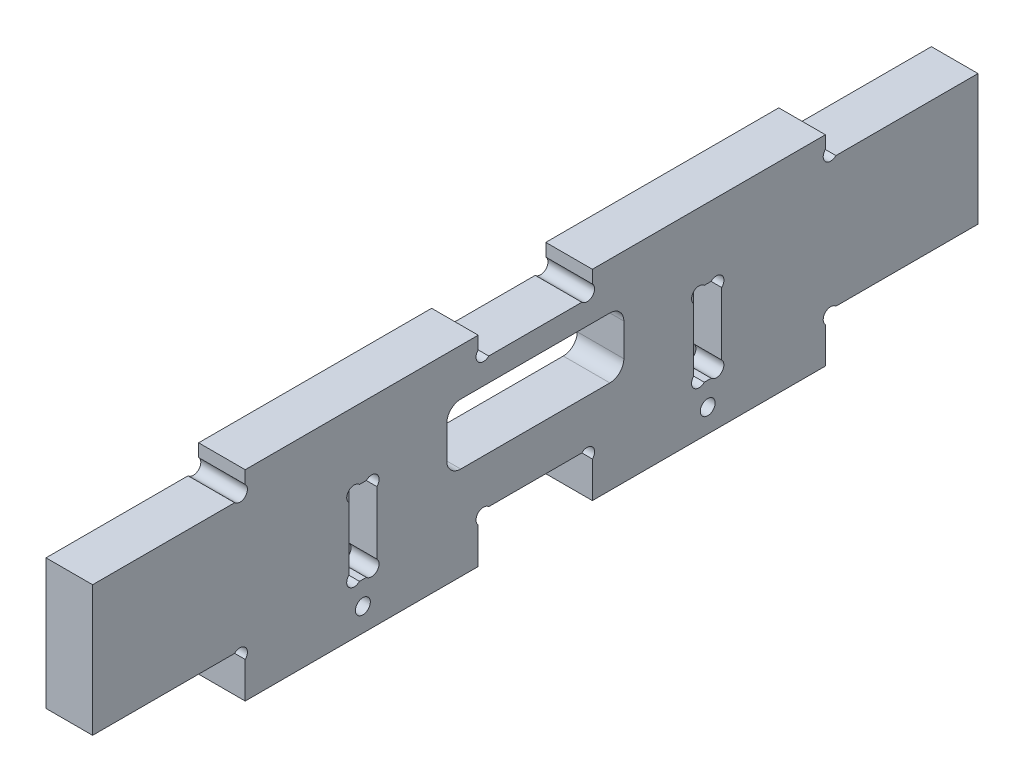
ISO-10303-21;
HEADER;
FILE_DESCRIPTION(('STEP AP214'),'2;1');
FILE_NAME('part.step','',(''),(''),'','','');
FILE_SCHEMA(('AUTOMOTIVE_DESIGN { 1 0 10303 214 1 1 1 1 }'));
ENDSEC;
DATA;
#1=APPLICATION_CONTEXT('core data for automotive mechanical design processes');
#2=APPLICATION_PROTOCOL_DEFINITION('international standard','automotive_design',2000,#1);
#3=PRODUCT_CONTEXT('',#1,'mechanical');
#4=PRODUCT('Part','Part','',(#3));
#5=PRODUCT_RELATED_PRODUCT_CATEGORY('part','',(#4));
#6=PRODUCT_DEFINITION_FORMATION('','',#4);
#7=PRODUCT_DEFINITION_CONTEXT('part definition',#1,'design');
#8=PRODUCT_DEFINITION('design','',#6,#7);
#9=PRODUCT_DEFINITION_SHAPE('','',#8);
#10=(LENGTH_UNIT() NAMED_UNIT(*) SI_UNIT(.MILLI.,.METRE.));
#11=(NAMED_UNIT(*) PLANE_ANGLE_UNIT() SI_UNIT($,.RADIAN.));
#12=(NAMED_UNIT(*) SI_UNIT($,.STERADIAN.) SOLID_ANGLE_UNIT());
#13=UNCERTAINTY_MEASURE_WITH_UNIT(LENGTH_MEASURE(1.E-05),#10,'distance_accuracy_value','');
#14=(GEOMETRIC_REPRESENTATION_CONTEXT(3) GLOBAL_UNCERTAINTY_ASSIGNED_CONTEXT((#13)) GLOBAL_UNIT_ASSIGNED_CONTEXT((#10,
#11,#12)) REPRESENTATION_CONTEXT('',''));
#15=CARTESIAN_POINT('',(0.,0.,0.));
#16=DIRECTION('',(0.,0.,1.));
#17=DIRECTION('',(1.,0.,0.));
#18=AXIS2_PLACEMENT_3D('',#15,#16,#17);
#19=CARTESIAN_POINT('',(10.,39.1313708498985,-83.8813708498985));
#20=DIRECTION('',(1.,0.,0.));
#21=DIRECTION('',(0.,0.,-1.));
#22=AXIS2_PLACEMENT_3D('',#19,#20,#21);
#23=PLANE('',#22);
#24=CARTESIAN_POINT('',(10.,26.8686291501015,-56.1313708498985));
#25=DIRECTION('',(1.,0.,0.));
#26=DIRECTION('',(0.,0.,-1.));
#27=AXIS2_PLACEMENT_3D('',#24,#25,#26);
#28=CIRCLE('',#27,1.59999999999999);
#29=CARTESIAN_POINT('',(10.,28.,-57.2627416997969));
#30=VERTEX_POINT('',#29);
#31=CARTESIAN_POINT('',(10.,25.737258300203,-55.));
#32=VERTEX_POINT('',#31);
#33=EDGE_CURVE('E47',#30,#32,#28,.T.);
#34=ORIENTED_EDGE('',*,*,#33,.F.);
#35=DIRECTION('',(0.,0.,1.));
#36=VECTOR('',#35,1.);
#37=CARTESIAN_POINT('',(10.,28.,-58.7372583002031));
#38=LINE('',#37,#36);
#39=CARTESIAN_POINT('',(10.,28.,-58.7372583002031));
#40=VERTEX_POINT('',#39);
#41=EDGE_CURVE('E397',#40,#30,#38,.T.);
#42=ORIENTED_EDGE('',*,*,#41,.F.);
#43=CARTESIAN_POINT('',(10.,26.8686291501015,-59.8686291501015));
#44=DIRECTION('',(1.,0.,0.));
#45=DIRECTION('',(0.,0.,1.));
#46=AXIS2_PLACEMENT_3D('',#43,#44,#45);
#47=CIRCLE('',#46,1.59999999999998);
#48=CARTESIAN_POINT('',(10.,25.737258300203,-61.));
#49=VERTEX_POINT('',#48);
#50=EDGE_CURVE('E394',#49,#40,#47,.T.);
#51=ORIENTED_EDGE('',*,*,#50,.F.);
#52=DIRECTION('',(0.,1.,0.));
#53=VECTOR('',#52,1.);
#54=CARTESIAN_POINT('',(10.,12.2627416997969,-61.));
#55=LINE('',#54,#53);
#56=CARTESIAN_POINT('',(10.,12.2627416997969,-61.));
#57=VERTEX_POINT('',#56);
#58=EDGE_CURVE('E391',#57,#49,#55,.T.);
#59=ORIENTED_EDGE('',*,*,#58,.F.);
#60=CARTESIAN_POINT('',(10.,11.1313708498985,-59.8686291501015));
#61=DIRECTION('',(1.,0.,0.));
#62=DIRECTION('',(0.,0.,-1.));
#63=AXIS2_PLACEMENT_3D('',#60,#61,#62);
#64=CIRCLE('',#63,1.6);
#65=CARTESIAN_POINT('',(10.,10.,-58.737258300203));
#66=VERTEX_POINT('',#65);
#67=EDGE_CURVE('E385',#66,#57,#64,.T.);
#68=ORIENTED_EDGE('',*,*,#67,.F.);
#69=DIRECTION('',(0.,0.,-1.));
#70=VECTOR('',#69,1.);
#71=CARTESIAN_POINT('',(10.,10.,-57.262741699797));
#72=LINE('',#71,#70);
#73=CARTESIAN_POINT('',(10.,10.,-57.262741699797));
#74=VERTEX_POINT('',#73);
#75=EDGE_CURVE('E383',#74,#66,#72,.T.);
#76=ORIENTED_EDGE('',*,*,#75,.F.);
#77=CARTESIAN_POINT('',(10.,11.1313708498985,-56.1313708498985));
#78=DIRECTION('',(1.,0.,0.));
#79=DIRECTION('',(0.,0.,1.));
#80=AXIS2_PLACEMENT_3D('',#77,#78,#79);
#81=CIRCLE('',#80,1.59999999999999);
#82=CARTESIAN_POINT('',(10.,12.2627416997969,-55.));
#83=VERTEX_POINT('',#82);
#84=EDGE_CURVE('E365',#83,#74,#81,.T.);
#85=ORIENTED_EDGE('',*,*,#84,.F.);
#86=DIRECTION('',(0.,-1.,0.));
#87=VECTOR('',#86,1.);
#88=CARTESIAN_POINT('',(10.,25.737258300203,-55.));
#89=LINE('',#88,#87);
#90=EDGE_CURVE('E376',#32,#83,#89,.T.);
#91=ORIENTED_EDGE('',*,*,#90,.F.);
#92=EDGE_LOOP('',(#34,#42,#51,#59,#68,#76,#85,#91));
#93=FACE_BOUND('',#92,.T.);
#94=CARTESIAN_POINT('',(10.,11.1313708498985,-133.868629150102));
#95=DIRECTION('',(1.,0.,0.));
#96=DIRECTION('',(0.,0.,-1.));
#97=AXIS2_PLACEMENT_3D('',#94,#95,#96);
#98=CIRCLE('',#97,1.6);
#99=CARTESIAN_POINT('',(10.,10.,-132.737258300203));
#100=VERTEX_POINT('',#99);
#101=CARTESIAN_POINT('',(10.,12.2627416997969,-135.));
#102=VERTEX_POINT('',#101);
#103=EDGE_CURVE('E55',#100,#102,#98,.T.);
#104=ORIENTED_EDGE('',*,*,#103,.F.);
#105=DIRECTION('',(0.,0.,-1.));
#106=VECTOR('',#105,1.);
#107=CARTESIAN_POINT('',(10.,10.,-132.737258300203));
#108=LINE('',#107,#106);
#109=CARTESIAN_POINT('',(10.,10.,-131.262741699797));
#110=VERTEX_POINT('',#109);
#111=EDGE_CURVE('E452',#110,#100,#108,.T.);
#112=ORIENTED_EDGE('',*,*,#111,.F.);
#113=CARTESIAN_POINT('',(10.,11.1313708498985,-130.131370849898));
#114=DIRECTION('',(1.,0.,0.));
#115=DIRECTION('',(0.,0.,1.));
#116=AXIS2_PLACEMENT_3D('',#113,#114,#115);
#117=CIRCLE('',#116,1.6);
#118=CARTESIAN_POINT('',(10.,12.2627416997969,-129.));
#119=VERTEX_POINT('',#118);
#120=EDGE_CURVE('E449',#119,#110,#117,.T.);
#121=ORIENTED_EDGE('',*,*,#120,.F.);
#122=DIRECTION('',(0.,-1.,0.));
#123=VECTOR('',#122,1.);
#124=CARTESIAN_POINT('',(10.,12.2627416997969,-129.));
#125=LINE('',#124,#123);
#126=CARTESIAN_POINT('',(10.,25.737258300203,-129.));
#127=VERTEX_POINT('',#126);
#128=EDGE_CURVE('E446',#127,#119,#125,.T.);
#129=ORIENTED_EDGE('',*,*,#128,.F.);
#130=CARTESIAN_POINT('',(10.,26.8686291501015,-130.131370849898));
#131=DIRECTION('',(1.,0.,0.));
#132=DIRECTION('',(0.,0.,-1.));
#133=AXIS2_PLACEMENT_3D('',#130,#131,#132);
#134=CIRCLE('',#133,1.59999999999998);
#135=CARTESIAN_POINT('',(10.,28.,-131.262741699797));
#136=VERTEX_POINT('',#135);
#137=EDGE_CURVE('E443',#136,#127,#134,.T.);
#138=ORIENTED_EDGE('',*,*,#137,.F.);
#139=DIRECTION('',(0.,0.,1.));
#140=VECTOR('',#139,1.);
#141=CARTESIAN_POINT('',(10.,28.,-131.262741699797));
#142=LINE('',#141,#140);
#143=CARTESIAN_POINT('',(10.,28.,-132.737258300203));
#144=VERTEX_POINT('',#143);
#145=EDGE_CURVE('E440',#144,#136,#142,.T.);
#146=ORIENTED_EDGE('',*,*,#145,.F.);
#147=CARTESIAN_POINT('',(10.,26.8686291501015,-133.868629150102));
#148=DIRECTION('',(1.,0.,0.));
#149=DIRECTION('',(0.,0.,1.));
#150=AXIS2_PLACEMENT_3D('',#147,#148,#149);
#151=CIRCLE('',#150,1.59999999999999);
#152=CARTESIAN_POINT('',(10.,25.737258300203,-135.));
#153=VERTEX_POINT('',#152);
#154=EDGE_CURVE('E437',#153,#144,#151,.T.);
#155=ORIENTED_EDGE('',*,*,#154,.F.);
#156=DIRECTION('',(0.,1.,0.));
#157=VECTOR('',#156,1.);
#158=CARTESIAN_POINT('',(10.,25.737258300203,-135.));
#159=LINE('',#158,#157);
#160=EDGE_CURVE('E434',#102,#153,#159,.T.);
#161=ORIENTED_EDGE('',*,*,#160,.F.);
#162=EDGE_LOOP('',(#104,#112,#121,#129,#138,#146,#155,#161));
#163=FACE_BOUND('',#162,.T.);
#164=CARTESIAN_POINT('',(10.,5.,-132.));
#165=DIRECTION('',(1.,0.,0.));
#166=DIRECTION('',(0.,0.,1.));
#167=AXIS2_PLACEMENT_3D('',#164,#165,#166);
#168=CIRCLE('',#167,1.59999999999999);
#169=CARTESIAN_POINT('',(10.,5.,-130.4));
#170=VERTEX_POINT('',#169);
#171=EDGE_CURVE('E557',#170,#170,#168,.T.);
#172=ORIENTED_EDGE('',*,*,#171,.F.);
#173=EDGE_LOOP('',(#172));
#174=FACE_BOUND('',#173,.T.);
#175=CARTESIAN_POINT('',(10.,39.1313708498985,-83.8813708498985));
#176=DIRECTION('',(-1.,0.,0.));
#177=DIRECTION('',(0.,0.,-1.));
#178=AXIS2_PLACEMENT_3D('',#175,#176,#177);
#179=CIRCLE('',#178,1.60000000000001);
#180=CARTESIAN_POINT('',(10.,38.,-85.012741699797));
#181=VERTEX_POINT('',#180);
#182=CARTESIAN_POINT('',(10.,40.2627416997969,-82.75));
#183=VERTEX_POINT('',#182);
#184=EDGE_CURVE('E623',#181,#183,#179,.T.);
#185=ORIENTED_EDGE('',*,*,#184,.T.);
#186=DIRECTION('',(0.,1.,0.));
#187=VECTOR('',#186,1.);
#188=CARTESIAN_POINT('',(10.,40.2627416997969,-82.75));
#189=LINE('',#188,#187);
#190=CARTESIAN_POINT('',(10.,42.9999999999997,-82.7499999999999));
#191=VERTEX_POINT('',#190);
#192=EDGE_CURVE('E626',#183,#191,#189,.T.);
#193=ORIENTED_EDGE('',*,*,#192,.T.);
#194=DIRECTION('',(0.,0.,1.));
#195=VECTOR('',#194,1.);
#196=CARTESIAN_POINT('',(10.,43.,-32.75));
#197=LINE('',#196,#195);
#198=CARTESIAN_POINT('',(10.,43.,-32.75));
#199=VERTEX_POINT('',#198);
#200=EDGE_CURVE('E628',#191,#199,#197,.T.);
#201=ORIENTED_EDGE('',*,*,#200,.T.);
#202=DIRECTION('',(0.,-1.,0.));
#203=VECTOR('',#202,1.);
#204=CARTESIAN_POINT('',(10.,40.2627416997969,-32.75));
#205=LINE('',#204,#203);
#206=CARTESIAN_POINT('',(10.,40.2627416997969,-32.75));
#207=VERTEX_POINT('',#206);
#208=EDGE_CURVE('E630',#199,#207,#205,.T.);
#209=ORIENTED_EDGE('',*,*,#208,.T.);
#210=CARTESIAN_POINT('',(10.,39.1313708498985,-31.6186291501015));
#211=DIRECTION('',(-1.,0.,0.));
#212=DIRECTION('',(0.,0.,1.));
#213=AXIS2_PLACEMENT_3D('',#210,#211,#212);
#214=CIRCLE('',#213,1.6);
#215=CARTESIAN_POINT('',(10.,38.,-30.487258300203));
#216=VERTEX_POINT('',#215);
#217=EDGE_CURVE('E632',#207,#216,#214,.T.);
#218=ORIENTED_EDGE('',*,*,#217,.T.);
#219=DIRECTION('',(0.,0.,1.));
#220=VECTOR('',#219,1.);
#221=CARTESIAN_POINT('',(10.,38.,-30.487258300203));
#222=LINE('',#221,#220);
#223=CARTESIAN_POINT('',(10.,38.,0.));
#224=VERTEX_POINT('',#223);
#225=EDGE_CURVE('E634',#216,#224,#222,.T.);
#226=ORIENTED_EDGE('',*,*,#225,.T.);
#227=DIRECTION('',(0.,-1.,0.));
#228=VECTOR('',#227,1.);
#229=CARTESIAN_POINT('',(10.,38.,0.));
#230=LINE('',#229,#228);
#231=CARTESIAN_POINT('',(10.,10.,0.));
#232=VERTEX_POINT('',#231);
#233=EDGE_CURVE('E636',#224,#232,#230,.T.);
#234=ORIENTED_EDGE('',*,*,#233,.T.);
#235=DIRECTION('',(0.,0.,-1.));
#236=VECTOR('',#235,1.);
#237=CARTESIAN_POINT('',(10.,10.,0.));
#238=LINE('',#237,#236);
#239=CARTESIAN_POINT('',(10.,9.99999999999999,-30.487258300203));
#240=VERTEX_POINT('',#239);
#241=EDGE_CURVE('E638',#232,#240,#238,.T.);
#242=ORIENTED_EDGE('',*,*,#241,.T.);
#243=CARTESIAN_POINT('',(10.,8.86862915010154,-31.6186291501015));
#244=DIRECTION('',(-1.,0.,0.));
#245=DIRECTION('',(0.,0.,1.));
#246=AXIS2_PLACEMENT_3D('',#243,#244,#245);
#247=CIRCLE('',#246,1.60000000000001);
#248=CARTESIAN_POINT('',(10.,7.73725830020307,-32.75));
#249=VERTEX_POINT('',#248);
#250=EDGE_CURVE('E640',#240,#249,#247,.T.);
#251=ORIENTED_EDGE('',*,*,#250,.T.);
#252=DIRECTION('',(0.,-1.,0.));
#253=VECTOR('',#252,1.);
#254=CARTESIAN_POINT('',(10.,7.73725830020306,-32.75));
#255=LINE('',#254,#253);
#256=CARTESIAN_POINT('',(10.,0.,-32.75));
#257=VERTEX_POINT('',#256);
#258=EDGE_CURVE('E642',#249,#257,#255,.T.);
#259=ORIENTED_EDGE('',*,*,#258,.T.);
#260=DIRECTION('',(0.,0.,-1.));
#261=VECTOR('',#260,1.);
#262=CARTESIAN_POINT('',(10.,0.,-32.75));
#263=LINE('',#262,#261);
#264=CARTESIAN_POINT('',(10.,0.,-82.75));
#265=VERTEX_POINT('',#264);
#266=EDGE_CURVE('E644',#257,#265,#263,.T.);
#267=ORIENTED_EDGE('',*,*,#266,.T.);
#268=DIRECTION('',(0.,1.,0.));
#269=VECTOR('',#268,1.);
#270=CARTESIAN_POINT('',(10.,7.73725830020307,-82.75));
#271=LINE('',#270,#269);
#272=CARTESIAN_POINT('',(10.,7.73725830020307,-82.75));
#273=VERTEX_POINT('',#272);
#274=EDGE_CURVE('E646',#265,#273,#271,.T.);
#275=ORIENTED_EDGE('',*,*,#274,.T.);
#276=CARTESIAN_POINT('',(10.,8.86862915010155,-83.8813708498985));
#277=DIRECTION('',(-1.,0.,0.));
#278=DIRECTION('',(0.,0.,-1.));
#279=AXIS2_PLACEMENT_3D('',#276,#277,#278);
#280=CIRCLE('',#279,1.60000000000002);
#281=CARTESIAN_POINT('',(10.,10.,-85.012741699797));
#282=VERTEX_POINT('',#281);
#283=EDGE_CURVE('E648',#273,#282,#280,.T.);
#284=ORIENTED_EDGE('',*,*,#283,.T.);
#285=DIRECTION('',(0.,0.,-1.));
#286=VECTOR('',#285,1.);
#287=CARTESIAN_POINT('',(10.,10.,-85.012741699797));
#288=LINE('',#287,#286);
#289=CARTESIAN_POINT('',(10.,10.,-104.987258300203));
#290=VERTEX_POINT('',#289);
#291=EDGE_CURVE('E650',#282,#290,#288,.T.);
#292=ORIENTED_EDGE('',*,*,#291,.T.);
#293=CARTESIAN_POINT('',(10.,8.86862915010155,-106.118629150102));
#294=DIRECTION('',(-1.,0.,0.));
#295=DIRECTION('',(0.,0.,1.));
#296=AXIS2_PLACEMENT_3D('',#293,#294,#295);
#297=CIRCLE('',#296,1.60000000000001);
#298=CARTESIAN_POINT('',(10.,7.73725830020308,-107.25));
#299=VERTEX_POINT('',#298);
#300=EDGE_CURVE('E652',#290,#299,#297,.T.);
#301=ORIENTED_EDGE('',*,*,#300,.T.);
#302=DIRECTION('',(0.,-1.,0.));
#303=VECTOR('',#302,1.);
#304=CARTESIAN_POINT('',(10.,7.73725830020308,-107.25));
#305=LINE('',#304,#303);
#306=CARTESIAN_POINT('',(10.,0.,-107.25));
#307=VERTEX_POINT('',#306);
#308=EDGE_CURVE('E654',#299,#307,#305,.T.);
#309=ORIENTED_EDGE('',*,*,#308,.T.);
#310=DIRECTION('',(0.,0.,-1.));
#311=VECTOR('',#310,1.);
#312=CARTESIAN_POINT('',(10.,0.,-157.25));
#313=LINE('',#312,#311);
#314=CARTESIAN_POINT('',(10.,0.,-157.25));
#315=VERTEX_POINT('',#314);
#316=EDGE_CURVE('E656',#307,#315,#313,.T.);
#317=ORIENTED_EDGE('',*,*,#316,.T.);
#318=DIRECTION('',(0.,1.,0.));
#319=VECTOR('',#318,1.);
#320=CARTESIAN_POINT('',(10.,7.73725830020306,-157.25));
#321=LINE('',#320,#319);
#322=CARTESIAN_POINT('',(10.,7.73725830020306,-157.25));
#323=VERTEX_POINT('',#322);
#324=EDGE_CURVE('E658',#315,#323,#321,.T.);
#325=ORIENTED_EDGE('',*,*,#324,.T.);
#326=CARTESIAN_POINT('',(10.,8.86862915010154,-158.381370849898));
#327=DIRECTION('',(-1.,0.,0.));
#328=DIRECTION('',(0.,0.,-1.));
#329=AXIS2_PLACEMENT_3D('',#326,#327,#328);
#330=CIRCLE('',#329,1.60000000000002);
#331=CARTESIAN_POINT('',(10.,9.99999999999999,-159.512741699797));
#332=VERTEX_POINT('',#331);
#333=EDGE_CURVE('E660',#323,#332,#330,.T.);
#334=ORIENTED_EDGE('',*,*,#333,.T.);
#335=DIRECTION('',(0.,0.,-1.));
#336=VECTOR('',#335,1.);
#337=CARTESIAN_POINT('',(10.,10.,-159.512741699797));
#338=LINE('',#337,#336);
#339=CARTESIAN_POINT('',(10.,10.,-190.));
#340=VERTEX_POINT('',#339);
#341=EDGE_CURVE('E662',#332,#340,#338,.T.);
#342=ORIENTED_EDGE('',*,*,#341,.T.);
#343=DIRECTION('',(0.,1.,0.));
#344=VECTOR('',#343,1.);
#345=CARTESIAN_POINT('',(10.,10.,-190.));
#346=LINE('',#345,#344);
#347=CARTESIAN_POINT('',(10.,38.,-190.));
#348=VERTEX_POINT('',#347);
#349=EDGE_CURVE('E664',#340,#348,#346,.T.);
#350=ORIENTED_EDGE('',*,*,#349,.T.);
#351=DIRECTION('',(0.,0.,1.));
#352=VECTOR('',#351,1.);
#353=CARTESIAN_POINT('',(10.,38.,-190.));
#354=LINE('',#353,#352);
#355=CARTESIAN_POINT('',(10.,38.,-159.512741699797));
#356=VERTEX_POINT('',#355);
#357=EDGE_CURVE('E666',#348,#356,#354,.T.);
#358=ORIENTED_EDGE('',*,*,#357,.T.);
#359=CARTESIAN_POINT('',(10.,39.1313708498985,-158.381370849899));
#360=DIRECTION('',(-1.,0.,0.));
#361=DIRECTION('',(0.,0.,-1.));
#362=AXIS2_PLACEMENT_3D('',#359,#360,#361);
#363=CIRCLE('',#362,1.6);
#364=CARTESIAN_POINT('',(10.,40.2627416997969,-157.25));
#365=VERTEX_POINT('',#364);
#366=EDGE_CURVE('E668',#356,#365,#363,.T.);
#367=ORIENTED_EDGE('',*,*,#366,.T.);
#368=DIRECTION('',(0.,1.,0.));
#369=VECTOR('',#368,1.);
#370=CARTESIAN_POINT('',(10.,40.2627416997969,-157.25));
#371=LINE('',#370,#369);
#372=CARTESIAN_POINT('',(10.,43.,-157.25));
#373=VERTEX_POINT('',#372);
#374=EDGE_CURVE('E670',#365,#373,#371,.T.);
#375=ORIENTED_EDGE('',*,*,#374,.T.);
#376=DIRECTION('',(0.,0.,1.));
#377=VECTOR('',#376,1.);
#378=CARTESIAN_POINT('',(10.,43.,-157.25));
#379=LINE('',#378,#377);
#380=CARTESIAN_POINT('',(10.,43.,-107.25));
#381=VERTEX_POINT('',#380);
#382=EDGE_CURVE('E672',#373,#381,#379,.T.);
#383=ORIENTED_EDGE('',*,*,#382,.T.);
#384=DIRECTION('',(0.,-1.,0.));
#385=VECTOR('',#384,1.);
#386=CARTESIAN_POINT('',(10.,40.262741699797,-107.25));
#387=LINE('',#386,#385);
#388=CARTESIAN_POINT('',(10.,40.262741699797,-107.25));
#389=VERTEX_POINT('',#388);
#390=EDGE_CURVE('E674',#381,#389,#387,.T.);
#391=ORIENTED_EDGE('',*,*,#390,.T.);
#392=CARTESIAN_POINT('',(10.,39.1313708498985,-106.118629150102));
#393=DIRECTION('',(-1.,0.,0.));
#394=DIRECTION('',(0.,0.,1.));
#395=AXIS2_PLACEMENT_3D('',#392,#393,#394);
#396=CIRCLE('',#395,1.6);
#397=CARTESIAN_POINT('',(10.,38.,-104.987258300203));
#398=VERTEX_POINT('',#397);
#399=EDGE_CURVE('E676',#389,#398,#396,.T.);
#400=ORIENTED_EDGE('',*,*,#399,.T.);
#401=DIRECTION('',(0.,0.,1.));
#402=VECTOR('',#401,1.);
#403=CARTESIAN_POINT('',(10.,38.,-85.012741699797));
#404=LINE('',#403,#402);
#405=EDGE_CURVE('E678',#398,#181,#404,.T.);
#406=ORIENTED_EDGE('',*,*,#405,.T.);
#407=EDGE_LOOP('',(#185,#193,#201,#209,#218,#226,#234,#242,#251,#259,#267,#275,#284,#292,#301,
#309,#317,#325,#334,#342,#350,#358,#367,#375,#383,#391,#400,#406));
#408=FACE_BOUND('',#407,.T.);
#409=CARTESIAN_POINT('',(10.,5.,-58.));
#410=DIRECTION('',(1.,0.,0.));
#411=DIRECTION('',(0.,0.,-1.));
#412=AXIS2_PLACEMENT_3D('',#409,#410,#411);
#413=CIRCLE('',#412,1.60000000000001);
#414=CARTESIAN_POINT('',(10.,5.,-59.6));
#415=VERTEX_POINT('',#414);
#416=EDGE_CURVE('E563',#415,#415,#413,.T.);
#417=ORIENTED_EDGE('',*,*,#416,.F.);
#418=EDGE_LOOP('',(#417));
#419=FACE_BOUND('',#418,.T.);
#420=DIRECTION('',(0.,-1.,0.));
#421=VECTOR('',#420,1.);
#422=CARTESIAN_POINT('',(10.,30.,-76.));
#423=LINE('',#422,#421);
#424=CARTESIAN_POINT('',(10.,30.,-76.));
#425=VERTEX_POINT('',#424);
#426=CARTESIAN_POINT('',(10.,23.,-76.));
#427=VERTEX_POINT('',#426);
#428=EDGE_CURVE('E521',#425,#427,#423,.T.);
#429=ORIENTED_EDGE('',*,*,#428,.F.);
#430=CARTESIAN_POINT('',(10.,30.,-79.));
#431=DIRECTION('',(1.,0.,0.));
#432=DIRECTION('',(0.,0.,1.));
#433=AXIS2_PLACEMENT_3D('',#430,#431,#432);
#434=CIRCLE('',#433,3.);
#435=CARTESIAN_POINT('',(10.,33.,-79.));
#436=VERTEX_POINT('',#435);
#437=EDGE_CURVE('E519',#436,#425,#434,.T.);
#438=ORIENTED_EDGE('',*,*,#437,.F.);
#439=DIRECTION('',(0.,0.,1.));
#440=VECTOR('',#439,1.);
#441=CARTESIAN_POINT('',(10.,33.,-79.));
#442=LINE('',#441,#440);
#443=CARTESIAN_POINT('',(10.,33.,-111.));
#444=VERTEX_POINT('',#443);
#445=EDGE_CURVE('E534',#444,#436,#442,.T.);
#446=ORIENTED_EDGE('',*,*,#445,.F.);
#447=CARTESIAN_POINT('',(10.,30.,-111.));
#448=DIRECTION('',(1.,0.,0.));
#449=DIRECTION('',(0.,0.,-1.));
#450=AXIS2_PLACEMENT_3D('',#447,#448,#449);
#451=CIRCLE('',#450,2.99999999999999);
#452=CARTESIAN_POINT('',(10.,30.,-114.));
#453=VERTEX_POINT('',#452);
#454=EDGE_CURVE('E531',#453,#444,#451,.T.);
#455=ORIENTED_EDGE('',*,*,#454,.F.);
#456=DIRECTION('',(0.,1.,0.));
#457=VECTOR('',#456,1.);
#458=CARTESIAN_POINT('',(10.,30.,-114.));
#459=LINE('',#458,#457);
#460=CARTESIAN_POINT('',(10.,23.,-114.));
#461=VERTEX_POINT('',#460);
#462=EDGE_CURVE('E529',#461,#453,#459,.T.);
#463=ORIENTED_EDGE('',*,*,#462,.F.);
#464=CARTESIAN_POINT('',(10.,23.,-111.));
#465=DIRECTION('',(1.,0.,0.));
#466=DIRECTION('',(0.,0.,1.));
#467=AXIS2_PLACEMENT_3D('',#464,#465,#466);
#468=CIRCLE('',#467,3.);
#469=CARTESIAN_POINT('',(10.,20.,-111.));
#470=VERTEX_POINT('',#469);
#471=EDGE_CURVE('E527',#470,#461,#468,.T.);
#472=ORIENTED_EDGE('',*,*,#471,.F.);
#473=DIRECTION('',(0.,0.,-1.));
#474=VECTOR('',#473,1.);
#475=CARTESIAN_POINT('',(10.,20.,-111.));
#476=LINE('',#475,#474);
#477=CARTESIAN_POINT('',(10.,20.,-79.));
#478=VERTEX_POINT('',#477);
#479=EDGE_CURVE('E525',#478,#470,#476,.T.);
#480=ORIENTED_EDGE('',*,*,#479,.F.);
#481=CARTESIAN_POINT('',(10.,23.,-79.));
#482=DIRECTION('',(1.,0.,0.));
#483=DIRECTION('',(0.,0.,-1.));
#484=AXIS2_PLACEMENT_3D('',#481,#482,#483);
#485=CIRCLE('',#484,3.);
#486=EDGE_CURVE('E523',#427,#478,#485,.T.);
#487=ORIENTED_EDGE('',*,*,#486,.F.);
#488=EDGE_LOOP('',(#429,#438,#446,#455,#463,#472,#480,#487));
#489=FACE_BOUND('',#488,.T.);
#490=ADVANCED_FACE('F32',(#93,#163,#174,#408,#419,#489),#23,.T.);
#491=CARTESIAN_POINT('',(0.,39.1313708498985,-83.8813708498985));
#492=DIRECTION('',(1.,0.,0.));
#493=DIRECTION('',(0.,0.,-1.));
#494=AXIS2_PLACEMENT_3D('',#491,#492,#493);
#495=PLANE('',#494);
#496=CARTESIAN_POINT('',(0.,5.,-132.));
#497=DIRECTION('',(1.,0.,0.));
#498=DIRECTION('',(0.,0.,1.));
#499=AXIS2_PLACEMENT_3D('',#496,#497,#498);
#500=CIRCLE('',#499,1.59999999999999);
#501=CARTESIAN_POINT('',(0.,5.,-130.4));
#502=VERTEX_POINT('',#501);
#503=EDGE_CURVE('E554',#502,#502,#500,.T.);
#504=ORIENTED_EDGE('',*,*,#503,.T.);
#505=EDGE_LOOP('',(#504));
#506=FACE_BOUND('',#505,.T.);
#507=CARTESIAN_POINT('',(0.,39.1313708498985,-83.8813708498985));
#508=DIRECTION('',(-1.,0.,0.));
#509=DIRECTION('',(0.,0.,-1.));
#510=AXIS2_PLACEMENT_3D('',#507,#508,#509);
#511=CIRCLE('',#510,1.60000000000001);
#512=CARTESIAN_POINT('',(0.,38.,-85.012741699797));
#513=VERTEX_POINT('',#512);
#514=CARTESIAN_POINT('',(0.,40.2627416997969,-82.75));
#515=VERTEX_POINT('',#514);
#516=EDGE_CURVE('E566',#513,#515,#511,.T.);
#517=ORIENTED_EDGE('',*,*,#516,.F.);
#518=DIRECTION('',(0.,0.,1.));
#519=VECTOR('',#518,1.);
#520=CARTESIAN_POINT('',(0.,38.,-85.012741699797));
#521=LINE('',#520,#519);
#522=CARTESIAN_POINT('',(0.,38.,-104.987258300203));
#523=VERTEX_POINT('',#522);
#524=EDGE_CURVE('E621',#523,#513,#521,.T.);
#525=ORIENTED_EDGE('',*,*,#524,.F.);
#526=CARTESIAN_POINT('',(0.,39.1313708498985,-106.118629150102));
#527=DIRECTION('',(-1.,0.,0.));
#528=DIRECTION('',(0.,0.,1.));
#529=AXIS2_PLACEMENT_3D('',#526,#527,#528);
#530=CIRCLE('',#529,1.6);
#531=CARTESIAN_POINT('',(0.,40.262741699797,-107.25));
#532=VERTEX_POINT('',#531);
#533=EDGE_CURVE('E619',#532,#523,#530,.T.);
#534=ORIENTED_EDGE('',*,*,#533,.F.);
#535=DIRECTION('',(0.,-1.,0.));
#536=VECTOR('',#535,1.);
#537=CARTESIAN_POINT('',(0.,40.262741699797,-107.25));
#538=LINE('',#537,#536);
#539=CARTESIAN_POINT('',(0.,43.,-107.25));
#540=VERTEX_POINT('',#539);
#541=EDGE_CURVE('E617',#540,#532,#538,.T.);
#542=ORIENTED_EDGE('',*,*,#541,.F.);
#543=DIRECTION('',(0.,0.,1.));
#544=VECTOR('',#543,1.);
#545=CARTESIAN_POINT('',(0.,43.,-157.25));
#546=LINE('',#545,#544);
#547=CARTESIAN_POINT('',(0.,43.,-157.25));
#548=VERTEX_POINT('',#547);
#549=EDGE_CURVE('E615',#548,#540,#546,.T.);
#550=ORIENTED_EDGE('',*,*,#549,.F.);
#551=DIRECTION('',(0.,1.,0.));
#552=VECTOR('',#551,1.);
#553=CARTESIAN_POINT('',(0.,40.2627416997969,-157.25));
#554=LINE('',#553,#552);
#555=CARTESIAN_POINT('',(0.,40.2627416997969,-157.25));
#556=VERTEX_POINT('',#555);
#557=EDGE_CURVE('E613',#556,#548,#554,.T.);
#558=ORIENTED_EDGE('',*,*,#557,.F.);
#559=CARTESIAN_POINT('',(0.,39.1313708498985,-158.381370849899));
#560=DIRECTION('',(-1.,0.,0.));
#561=DIRECTION('',(0.,0.,-1.));
#562=AXIS2_PLACEMENT_3D('',#559,#560,#561);
#563=CIRCLE('',#562,1.6);
#564=CARTESIAN_POINT('',(0.,38.,-159.512741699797));
#565=VERTEX_POINT('',#564);
#566=EDGE_CURVE('E611',#565,#556,#563,.T.);
#567=ORIENTED_EDGE('',*,*,#566,.F.);
#568=DIRECTION('',(0.,0.,1.));
#569=VECTOR('',#568,1.);
#570=CARTESIAN_POINT('',(0.,38.,-190.));
#571=LINE('',#570,#569);
#572=CARTESIAN_POINT('',(0.,38.,-190.));
#573=VERTEX_POINT('',#572);
#574=EDGE_CURVE('E609',#573,#565,#571,.T.);
#575=ORIENTED_EDGE('',*,*,#574,.F.);
#576=DIRECTION('',(0.,1.,0.));
#577=VECTOR('',#576,1.);
#578=CARTESIAN_POINT('',(0.,10.,-190.));
#579=LINE('',#578,#577);
#580=CARTESIAN_POINT('',(0.,10.,-190.));
#581=VERTEX_POINT('',#580);
#582=EDGE_CURVE('E607',#581,#573,#579,.T.);
#583=ORIENTED_EDGE('',*,*,#582,.F.);
#584=DIRECTION('',(0.,0.,-1.));
#585=VECTOR('',#584,1.);
#586=CARTESIAN_POINT('',(0.,10.,-159.512741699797));
#587=LINE('',#586,#585);
#588=CARTESIAN_POINT('',(0.,9.99999999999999,-159.512741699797));
#589=VERTEX_POINT('',#588);
#590=EDGE_CURVE('E605',#589,#581,#587,.T.);
#591=ORIENTED_EDGE('',*,*,#590,.F.);
#592=CARTESIAN_POINT('',(0.,8.86862915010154,-158.381370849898));
#593=DIRECTION('',(-1.,0.,0.));
#594=DIRECTION('',(0.,0.,-1.));
#595=AXIS2_PLACEMENT_3D('',#592,#593,#594);
#596=CIRCLE('',#595,1.60000000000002);
#597=CARTESIAN_POINT('',(0.,7.73725830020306,-157.25));
#598=VERTEX_POINT('',#597);
#599=EDGE_CURVE('E603',#598,#589,#596,.T.);
#600=ORIENTED_EDGE('',*,*,#599,.F.);
#601=DIRECTION('',(0.,1.,0.));
#602=VECTOR('',#601,1.);
#603=CARTESIAN_POINT('',(0.,7.73725830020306,-157.25));
#604=LINE('',#603,#602);
#605=CARTESIAN_POINT('',(0.,0.,-157.25));
#606=VERTEX_POINT('',#605);
#607=EDGE_CURVE('E601',#606,#598,#604,.T.);
#608=ORIENTED_EDGE('',*,*,#607,.F.);
#609=DIRECTION('',(0.,0.,-1.));
#610=VECTOR('',#609,1.);
#611=CARTESIAN_POINT('',(0.,0.,-157.25));
#612=LINE('',#611,#610);
#613=CARTESIAN_POINT('',(0.,0.,-107.25));
#614=VERTEX_POINT('',#613);
#615=EDGE_CURVE('E599',#614,#606,#612,.T.);
#616=ORIENTED_EDGE('',*,*,#615,.F.);
#617=DIRECTION('',(0.,-1.,0.));
#618=VECTOR('',#617,1.);
#619=CARTESIAN_POINT('',(0.,7.73725830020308,-107.25));
#620=LINE('',#619,#618);
#621=CARTESIAN_POINT('',(0.,7.73725830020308,-107.25));
#622=VERTEX_POINT('',#621);
#623=EDGE_CURVE('E597',#622,#614,#620,.T.);
#624=ORIENTED_EDGE('',*,*,#623,.F.);
#625=CARTESIAN_POINT('',(0.,8.86862915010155,-106.118629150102));
#626=DIRECTION('',(-1.,0.,0.));
#627=DIRECTION('',(0.,0.,1.));
#628=AXIS2_PLACEMENT_3D('',#625,#626,#627);
#629=CIRCLE('',#628,1.60000000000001);
#630=CARTESIAN_POINT('',(0.,10.,-104.987258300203));
#631=VERTEX_POINT('',#630);
#632=EDGE_CURVE('E595',#631,#622,#629,.T.);
#633=ORIENTED_EDGE('',*,*,#632,.F.);
#634=DIRECTION('',(0.,0.,-1.));
#635=VECTOR('',#634,1.);
#636=CARTESIAN_POINT('',(0.,10.,-85.012741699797));
#637=LINE('',#636,#635);
#638=CARTESIAN_POINT('',(0.,10.,-85.012741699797));
#639=VERTEX_POINT('',#638);
#640=EDGE_CURVE('E593',#639,#631,#637,.T.);
#641=ORIENTED_EDGE('',*,*,#640,.F.);
#642=CARTESIAN_POINT('',(0.,8.86862915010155,-83.8813708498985));
#643=DIRECTION('',(-1.,0.,0.));
#644=DIRECTION('',(0.,0.,-1.));
#645=AXIS2_PLACEMENT_3D('',#642,#643,#644);
#646=CIRCLE('',#645,1.60000000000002);
#647=CARTESIAN_POINT('',(0.,7.73725830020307,-82.75));
#648=VERTEX_POINT('',#647);
#649=EDGE_CURVE('E591',#648,#639,#646,.T.);
#650=ORIENTED_EDGE('',*,*,#649,.F.);
#651=DIRECTION('',(0.,1.,0.));
#652=VECTOR('',#651,1.);
#653=CARTESIAN_POINT('',(0.,7.73725830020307,-82.75));
#654=LINE('',#653,#652);
#655=CARTESIAN_POINT('',(0.,0.,-82.75));
#656=VERTEX_POINT('',#655);
#657=EDGE_CURVE('E589',#656,#648,#654,.T.);
#658=ORIENTED_EDGE('',*,*,#657,.F.);
#659=DIRECTION('',(0.,0.,-1.));
#660=VECTOR('',#659,1.);
#661=CARTESIAN_POINT('',(0.,0.,-32.75));
#662=LINE('',#661,#660);
#663=CARTESIAN_POINT('',(0.,0.,-32.75));
#664=VERTEX_POINT('',#663);
#665=EDGE_CURVE('E587',#664,#656,#662,.T.);
#666=ORIENTED_EDGE('',*,*,#665,.F.);
#667=DIRECTION('',(0.,-1.,0.));
#668=VECTOR('',#667,1.);
#669=CARTESIAN_POINT('',(0.,7.73725830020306,-32.75));
#670=LINE('',#669,#668);
#671=CARTESIAN_POINT('',(0.,7.73725830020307,-32.75));
#672=VERTEX_POINT('',#671);
#673=EDGE_CURVE('E585',#672,#664,#670,.T.);
#674=ORIENTED_EDGE('',*,*,#673,.F.);
#675=CARTESIAN_POINT('',(0.,8.86862915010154,-31.6186291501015));
#676=DIRECTION('',(-1.,0.,0.));
#677=DIRECTION('',(0.,0.,1.));
#678=AXIS2_PLACEMENT_3D('',#675,#676,#677);
#679=CIRCLE('',#678,1.60000000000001);
#680=CARTESIAN_POINT('',(0.,9.99999999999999,-30.487258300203));
#681=VERTEX_POINT('',#680);
#682=EDGE_CURVE('E583',#681,#672,#679,.T.);
#683=ORIENTED_EDGE('',*,*,#682,.F.);
#684=DIRECTION('',(0.,0.,-1.));
#685=VECTOR('',#684,1.);
#686=CARTESIAN_POINT('',(0.,10.,0.));
#687=LINE('',#686,#685);
#688=CARTESIAN_POINT('',(0.,10.,0.));
#689=VERTEX_POINT('',#688);
#690=EDGE_CURVE('E581',#689,#681,#687,.T.);
#691=ORIENTED_EDGE('',*,*,#690,.F.);
#692=DIRECTION('',(0.,-1.,0.));
#693=VECTOR('',#692,1.);
#694=CARTESIAN_POINT('',(0.,38.,0.));
#695=LINE('',#694,#693);
#696=CARTESIAN_POINT('',(0.,38.,0.));
#697=VERTEX_POINT('',#696);
#698=EDGE_CURVE('E579',#697,#689,#695,.T.);
#699=ORIENTED_EDGE('',*,*,#698,.F.);
#700=DIRECTION('',(0.,0.,1.));
#701=VECTOR('',#700,1.);
#702=CARTESIAN_POINT('',(0.,38.,-30.487258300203));
#703=LINE('',#702,#701);
#704=CARTESIAN_POINT('',(0.,38.,-30.487258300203));
#705=VERTEX_POINT('',#704);
#706=EDGE_CURVE('E577',#705,#697,#703,.T.);
#707=ORIENTED_EDGE('',*,*,#706,.F.);
#708=CARTESIAN_POINT('',(0.,39.1313708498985,-31.6186291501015));
#709=DIRECTION('',(-1.,0.,0.));
#710=DIRECTION('',(0.,0.,1.));
#711=AXIS2_PLACEMENT_3D('',#708,#709,#710);
#712=CIRCLE('',#711,1.6);
#713=CARTESIAN_POINT('',(0.,40.2627416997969,-32.75));
#714=VERTEX_POINT('',#713);
#715=EDGE_CURVE('E575',#714,#705,#712,.T.);
#716=ORIENTED_EDGE('',*,*,#715,.F.);
#717=DIRECTION('',(0.,-1.,0.));
#718=VECTOR('',#717,1.);
#719=CARTESIAN_POINT('',(0.,40.2627416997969,-32.75));
#720=LINE('',#719,#718);
#721=CARTESIAN_POINT('',(0.,43.,-32.75));
#722=VERTEX_POINT('',#721);
#723=EDGE_CURVE('E573',#722,#714,#720,.T.);
#724=ORIENTED_EDGE('',*,*,#723,.F.);
#725=DIRECTION('',(0.,0.,1.));
#726=VECTOR('',#725,1.);
#727=CARTESIAN_POINT('',(0.,43.,-32.75));
#728=LINE('',#727,#726);
#729=CARTESIAN_POINT('',(0.,42.9999999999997,-82.7499999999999));
#730=VERTEX_POINT('',#729);
#731=EDGE_CURVE('E571',#730,#722,#728,.T.);
#732=ORIENTED_EDGE('',*,*,#731,.F.);
#733=DIRECTION('',(0.,1.,0.));
#734=VECTOR('',#733,1.);
#735=CARTESIAN_POINT('',(0.,40.2627416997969,-82.75));
#736=LINE('',#735,#734);
#737=EDGE_CURVE('E569',#515,#730,#736,.T.);
#738=ORIENTED_EDGE('',*,*,#737,.F.);
#739=EDGE_LOOP('',(#517,#525,#534,#542,#550,#558,#567,#575,#583,#591,#600,#608,#616,#624,#633,
#641,#650,#658,#666,#674,#683,#691,#699,#707,#716,#724,#732,#738));
#740=FACE_BOUND('',#739,.T.);
#741=CARTESIAN_POINT('',(0.,5.,-58.));
#742=DIRECTION('',(1.,0.,0.));
#743=DIRECTION('',(0.,0.,-1.));
#744=AXIS2_PLACEMENT_3D('',#741,#742,#743);
#745=CIRCLE('',#744,1.60000000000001);
#746=CARTESIAN_POINT('',(0.,5.,-59.6));
#747=VERTEX_POINT('',#746);
#748=EDGE_CURVE('E560',#747,#747,#745,.T.);
#749=ORIENTED_EDGE('',*,*,#748,.T.);
#750=EDGE_LOOP('',(#749));
#751=FACE_BOUND('',#750,.T.);
#752=CARTESIAN_POINT('',(0.,30.,-79.));
#753=DIRECTION('',(1.,0.,0.));
#754=DIRECTION('',(0.,0.,1.));
#755=AXIS2_PLACEMENT_3D('',#752,#753,#754);
#756=CIRCLE('',#755,3.);
#757=CARTESIAN_POINT('',(0.,33.,-79.));
#758=VERTEX_POINT('',#757);
#759=CARTESIAN_POINT('',(0.,30.,-76.));
#760=VERTEX_POINT('',#759);
#761=EDGE_CURVE('E482',#758,#760,#756,.T.);
#762=ORIENTED_EDGE('',*,*,#761,.T.);
#763=DIRECTION('',(0.,-1.,0.));
#764=VECTOR('',#763,1.);
#765=CARTESIAN_POINT('',(0.,30.,-76.));
#766=LINE('',#765,#764);
#767=CARTESIAN_POINT('',(0.,23.,-76.));
#768=VERTEX_POINT('',#767);
#769=EDGE_CURVE('E498',#760,#768,#766,.T.);
#770=ORIENTED_EDGE('',*,*,#769,.T.);
#771=CARTESIAN_POINT('',(0.,23.,-79.));
#772=DIRECTION('',(1.,0.,0.));
#773=DIRECTION('',(0.,0.,-1.));
#774=AXIS2_PLACEMENT_3D('',#771,#772,#773);
#775=CIRCLE('',#774,3.);
#776=CARTESIAN_POINT('',(0.,20.,-79.));
#777=VERTEX_POINT('',#776);
#778=EDGE_CURVE('E501',#768,#777,#775,.T.);
#779=ORIENTED_EDGE('',*,*,#778,.T.);
#780=DIRECTION('',(0.,0.,-1.));
#781=VECTOR('',#780,1.);
#782=CARTESIAN_POINT('',(0.,20.,-111.));
#783=LINE('',#782,#781);
#784=CARTESIAN_POINT('',(0.,20.,-111.));
#785=VERTEX_POINT('',#784);
#786=EDGE_CURVE('E504',#777,#785,#783,.T.);
#787=ORIENTED_EDGE('',*,*,#786,.T.);
#788=CARTESIAN_POINT('',(0.,23.,-111.));
#789=DIRECTION('',(1.,0.,0.));
#790=DIRECTION('',(0.,0.,1.));
#791=AXIS2_PLACEMENT_3D('',#788,#789,#790);
#792=CIRCLE('',#791,3.);
#793=CARTESIAN_POINT('',(0.,23.,-114.));
#794=VERTEX_POINT('',#793);
#795=EDGE_CURVE('E507',#785,#794,#792,.T.);
#796=ORIENTED_EDGE('',*,*,#795,.T.);
#797=DIRECTION('',(0.,1.,0.));
#798=VECTOR('',#797,1.);
#799=CARTESIAN_POINT('',(0.,30.,-114.));
#800=LINE('',#799,#798);
#801=CARTESIAN_POINT('',(0.,30.,-114.));
#802=VERTEX_POINT('',#801);
#803=EDGE_CURVE('E510',#794,#802,#800,.T.);
#804=ORIENTED_EDGE('',*,*,#803,.T.);
#805=CARTESIAN_POINT('',(0.,30.,-111.));
#806=DIRECTION('',(1.,0.,0.));
#807=DIRECTION('',(0.,0.,-1.));
#808=AXIS2_PLACEMENT_3D('',#805,#806,#807);
#809=CIRCLE('',#808,2.99999999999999);
#810=CARTESIAN_POINT('',(0.,33.,-111.));
#811=VERTEX_POINT('',#810);
#812=EDGE_CURVE('E513',#802,#811,#809,.T.);
#813=ORIENTED_EDGE('',*,*,#812,.T.);
#814=DIRECTION('',(0.,0.,1.));
#815=VECTOR('',#814,1.);
#816=CARTESIAN_POINT('',(0.,33.,-79.));
#817=LINE('',#816,#815);
#818=EDGE_CURVE('E516',#811,#758,#817,.T.);
#819=ORIENTED_EDGE('',*,*,#818,.T.);
#820=EDGE_LOOP('',(#762,#770,#779,#787,#796,#804,#813,#819));
#821=FACE_BOUND('',#820,.T.);
#822=ADVANCED_FACE('F768',(#506,#740,#751,#821),#495,.F.);
#823=CARTESIAN_POINT('',(10.,39.1313708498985,-83.8813708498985));
#824=DIRECTION('',(-1.,0.,0.));
#825=DIRECTION('',(0.,0.,1.));
#826=AXIS2_PLACEMENT_3D('',#823,#824,#825);
#827=CYLINDRICAL_SURFACE('',#826,1.60000000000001);
#828=ORIENTED_EDGE('',*,*,#516,.T.);
#829=DIRECTION('',(-1.,0.,0.));
#830=VECTOR('',#829,1.);
#831=CARTESIAN_POINT('',(10.,40.2627416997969,-82.75));
#832=LINE('',#831,#830);
#833=EDGE_CURVE('E11',#183,#515,#832,.T.);
#834=ORIENTED_EDGE('',*,*,#833,.F.);
#835=ORIENTED_EDGE('',*,*,#184,.F.);
#836=DIRECTION('',(-1.,0.,0.));
#837=VECTOR('',#836,1.);
#838=CARTESIAN_POINT('',(10.,38.,-85.012741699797));
#839=LINE('',#838,#837);
#840=EDGE_CURVE('E680',#181,#513,#839,.T.);
#841=ORIENTED_EDGE('',*,*,#840,.T.);
#842=EDGE_LOOP('',(#828,#834,#835,#841));
#843=FACE_BOUND('',#842,.T.);
#844=ADVANCED_FACE('F34',(#843),#827,.F.);
#845=CARTESIAN_POINT('',(10.,40.2627416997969,-82.75));
#846=DIRECTION('',(0.,0.,1.));
#847=DIRECTION('',(0.,-1.,0.));
#848=AXIS2_PLACEMENT_3D('',#845,#846,#847);
#849=PLANE('',#848);
#850=ORIENTED_EDGE('',*,*,#737,.T.);
#851=DIRECTION('',(-1.,0.,0.));
#852=VECTOR('',#851,1.);
#853=CARTESIAN_POINT('',(10.,42.9999999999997,-82.7499999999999));
#854=LINE('',#853,#852);
#855=EDGE_CURVE('E40',#191,#730,#854,.T.);
#856=ORIENTED_EDGE('',*,*,#855,.F.);
#857=ORIENTED_EDGE('',*,*,#192,.F.);
#858=ORIENTED_EDGE('',*,*,#833,.T.);
#859=EDGE_LOOP('',(#850,#856,#857,#858));
#860=FACE_BOUND('',#859,.T.);
#861=ADVANCED_FACE('F786',(#860),#849,.F.);
#862=CARTESIAN_POINT('',(10.,43.,-32.75));
#863=DIRECTION('',(0.,-1.,0.));
#864=DIRECTION('',(0.,0.,-1.));
#865=AXIS2_PLACEMENT_3D('',#862,#863,#864);
#866=PLANE('',#865);
#867=ORIENTED_EDGE('',*,*,#731,.T.);
#868=DIRECTION('',(-1.,0.,0.));
#869=VECTOR('',#868,1.);
#870=CARTESIAN_POINT('',(10.,43.,-32.75));
#871=LINE('',#870,#869);
#872=EDGE_CURVE('E755',#199,#722,#871,.T.);
#873=ORIENTED_EDGE('',*,*,#872,.F.);
#874=ORIENTED_EDGE('',*,*,#200,.F.);
#875=ORIENTED_EDGE('',*,*,#855,.T.);
#876=EDGE_LOOP('',(#867,#873,#874,#875));
#877=FACE_BOUND('',#876,.T.);
#878=ADVANCED_FACE('F762',(#877),#866,.F.);
#879=CARTESIAN_POINT('',(10.,40.2627416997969,-32.75));
#880=DIRECTION('',(0.,0.,-1.));
#881=DIRECTION('',(0.,1.,0.));
#882=AXIS2_PLACEMENT_3D('',#879,#880,#881);
#883=PLANE('',#882);
#884=ORIENTED_EDGE('',*,*,#723,.T.);
#885=DIRECTION('',(-1.,0.,0.));
#886=VECTOR('',#885,1.);
#887=CARTESIAN_POINT('',(10.,40.2627416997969,-32.75));
#888=LINE('',#887,#886);
#889=EDGE_CURVE('E752',#207,#714,#888,.T.);
#890=ORIENTED_EDGE('',*,*,#889,.F.);
#891=ORIENTED_EDGE('',*,*,#208,.F.);
#892=ORIENTED_EDGE('',*,*,#872,.T.);
#893=EDGE_LOOP('',(#884,#890,#891,#892));
#894=FACE_BOUND('',#893,.T.);
#895=ADVANCED_FACE('F774',(#894),#883,.F.);
#896=CARTESIAN_POINT('',(10.,39.1313708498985,-31.6186291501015));
#897=DIRECTION('',(-1.,0.,0.));
#898=DIRECTION('',(0.,0.,1.));
#899=AXIS2_PLACEMENT_3D('',#896,#897,#898);
#900=CYLINDRICAL_SURFACE('',#899,1.6);
#901=ORIENTED_EDGE('',*,*,#715,.T.);
#902=DIRECTION('',(-1.,0.,0.));
#903=VECTOR('',#902,1.);
#904=CARTESIAN_POINT('',(10.,38.,-30.487258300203));
#905=LINE('',#904,#903);
#906=EDGE_CURVE('E749',#216,#705,#905,.T.);
#907=ORIENTED_EDGE('',*,*,#906,.F.);
#908=ORIENTED_EDGE('',*,*,#217,.F.);
#909=ORIENTED_EDGE('',*,*,#889,.T.);
#910=EDGE_LOOP('',(#901,#907,#908,#909));
#911=FACE_BOUND('',#910,.T.);
#912=ADVANCED_FACE('F778',(#911),#900,.F.);
#913=CARTESIAN_POINT('',(10.,38.,-30.487258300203));
#914=DIRECTION('',(0.,-1.,0.));
#915=DIRECTION('',(0.,0.,-1.));
#916=AXIS2_PLACEMENT_3D('',#913,#914,#915);
#917=PLANE('',#916);
#918=ORIENTED_EDGE('',*,*,#706,.T.);
#919=DIRECTION('',(-1.,0.,0.));
#920=VECTOR('',#919,1.);
#921=CARTESIAN_POINT('',(10.,38.,0.));
#922=LINE('',#921,#920);
#923=EDGE_CURVE('E746',#224,#697,#922,.T.);
#924=ORIENTED_EDGE('',*,*,#923,.F.);
#925=ORIENTED_EDGE('',*,*,#225,.F.);
#926=ORIENTED_EDGE('',*,*,#906,.T.);
#927=EDGE_LOOP('',(#918,#924,#925,#926));
#928=FACE_BOUND('',#927,.T.);
#929=ADVANCED_FACE('F899',(#928),#917,.F.);
#930=CARTESIAN_POINT('',(10.,38.,0.));
#931=DIRECTION('',(0.,0.,-1.));
#932=DIRECTION('',(-1.,0.,0.));
#933=AXIS2_PLACEMENT_3D('',#930,#931,#932);
#934=PLANE('',#933);
#935=ORIENTED_EDGE('',*,*,#698,.T.);
#936=DIRECTION('',(-1.,0.,0.));
#937=VECTOR('',#936,1.);
#938=CARTESIAN_POINT('',(10.,10.,0.));
#939=LINE('',#938,#937);
#940=EDGE_CURVE('E743',#232,#689,#939,.T.);
#941=ORIENTED_EDGE('',*,*,#940,.F.);
#942=ORIENTED_EDGE('',*,*,#233,.F.);
#943=ORIENTED_EDGE('',*,*,#923,.T.);
#944=EDGE_LOOP('',(#935,#941,#942,#943));
#945=FACE_BOUND('',#944,.T.);
#946=ADVANCED_FACE('F896',(#945),#934,.F.);
#947=CARTESIAN_POINT('',(10.,10.,0.));
#948=DIRECTION('',(0.,1.,0.));
#949=DIRECTION('',(0.,0.,1.));
#950=AXIS2_PLACEMENT_3D('',#947,#948,#949);
#951=PLANE('',#950);
#952=ORIENTED_EDGE('',*,*,#690,.T.);
#953=DIRECTION('',(-1.,0.,0.));
#954=VECTOR('',#953,1.);
#955=CARTESIAN_POINT('',(10.,9.99999999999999,-30.487258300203));
#956=LINE('',#955,#954);
#957=EDGE_CURVE('E740',#240,#681,#956,.T.);
#958=ORIENTED_EDGE('',*,*,#957,.F.);
#959=ORIENTED_EDGE('',*,*,#241,.F.);
#960=ORIENTED_EDGE('',*,*,#940,.T.);
#961=EDGE_LOOP('',(#952,#958,#959,#960));
#962=FACE_BOUND('',#961,.T.);
#963=ADVANCED_FACE('F892',(#962),#951,.F.);
#964=CARTESIAN_POINT('',(10.,8.86862915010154,-31.6186291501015));
#965=DIRECTION('',(-1.,0.,0.));
#966=DIRECTION('',(0.,0.,1.));
#967=AXIS2_PLACEMENT_3D('',#964,#965,#966);
#968=CYLINDRICAL_SURFACE('',#967,1.60000000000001);
#969=ORIENTED_EDGE('',*,*,#682,.T.);
#970=DIRECTION('',(-1.,0.,0.));
#971=VECTOR('',#970,1.);
#972=CARTESIAN_POINT('',(10.,7.73725830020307,-32.75));
#973=LINE('',#972,#971);
#974=EDGE_CURVE('E737',#249,#672,#973,.T.);
#975=ORIENTED_EDGE('',*,*,#974,.F.);
#976=ORIENTED_EDGE('',*,*,#250,.F.);
#977=ORIENTED_EDGE('',*,*,#957,.T.);
#978=EDGE_LOOP('',(#969,#975,#976,#977));
#979=FACE_BOUND('',#978,.T.);
#980=ADVANCED_FACE('F888',(#979),#968,.F.);
#981=CARTESIAN_POINT('',(10.,7.73725830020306,-32.75));
#982=DIRECTION('',(0.,0.,-1.));
#983=DIRECTION('',(0.,1.,0.));
#984=AXIS2_PLACEMENT_3D('',#981,#982,#983);
#985=PLANE('',#984);
#986=ORIENTED_EDGE('',*,*,#673,.T.);
#987=DIRECTION('',(-1.,0.,0.));
#988=VECTOR('',#987,1.);
#989=CARTESIAN_POINT('',(10.,0.,-32.75));
#990=LINE('',#989,#988);
#991=EDGE_CURVE('E734',#257,#664,#990,.T.);
#992=ORIENTED_EDGE('',*,*,#991,.F.);
#993=ORIENTED_EDGE('',*,*,#258,.F.);
#994=ORIENTED_EDGE('',*,*,#974,.T.);
#995=EDGE_LOOP('',(#986,#992,#993,#994));
#996=FACE_BOUND('',#995,.T.);
#997=ADVANCED_FACE('F883',(#996),#985,.F.);
#998=CARTESIAN_POINT('',(10.,0.,-32.75));
#999=DIRECTION('',(0.,1.,0.));
#1000=DIRECTION('',(0.,0.,1.));
#1001=AXIS2_PLACEMENT_3D('',#998,#999,#1000);
#1002=PLANE('',#1001);
#1003=ORIENTED_EDGE('',*,*,#665,.T.);
#1004=DIRECTION('',(-1.,0.,0.));
#1005=VECTOR('',#1004,1.);
#1006=CARTESIAN_POINT('',(10.,0.,-82.75));
#1007=LINE('',#1006,#1005);
#1008=EDGE_CURVE('E731',#265,#656,#1007,.T.);
#1009=ORIENTED_EDGE('',*,*,#1008,.F.);
#1010=ORIENTED_EDGE('',*,*,#266,.F.);
#1011=ORIENTED_EDGE('',*,*,#991,.T.);
#1012=EDGE_LOOP('',(#1003,#1009,#1010,#1011));
#1013=FACE_BOUND('',#1012,.T.);
#1014=ADVANCED_FACE('F877',(#1013),#1002,.F.);
#1015=CARTESIAN_POINT('',(10.,7.73725830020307,-82.75));
#1016=DIRECTION('',(0.,0.,1.));
#1017=DIRECTION('',(0.,-1.,0.));
#1018=AXIS2_PLACEMENT_3D('',#1015,#1016,#1017);
#1019=PLANE('',#1018);
#1020=ORIENTED_EDGE('',*,*,#657,.T.);
#1021=DIRECTION('',(-1.,0.,0.));
#1022=VECTOR('',#1021,1.);
#1023=CARTESIAN_POINT('',(10.,7.73725830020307,-82.75));
#1024=LINE('',#1023,#1022);
#1025=EDGE_CURVE('E728',#273,#648,#1024,.T.);
#1026=ORIENTED_EDGE('',*,*,#1025,.F.);
#1027=ORIENTED_EDGE('',*,*,#274,.F.);
#1028=ORIENTED_EDGE('',*,*,#1008,.T.);
#1029=EDGE_LOOP('',(#1020,#1026,#1027,#1028));
#1030=FACE_BOUND('',#1029,.T.);
#1031=ADVANCED_FACE('F873',(#1030),#1019,.F.);
#1032=CARTESIAN_POINT('',(10.,8.86862915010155,-83.8813708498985));
#1033=DIRECTION('',(-1.,0.,0.));
#1034=DIRECTION('',(0.,0.,1.));
#1035=AXIS2_PLACEMENT_3D('',#1032,#1033,#1034);
#1036=CYLINDRICAL_SURFACE('',#1035,1.60000000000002);
#1037=ORIENTED_EDGE('',*,*,#649,.T.);
#1038=DIRECTION('',(-1.,0.,0.));
#1039=VECTOR('',#1038,1.);
#1040=CARTESIAN_POINT('',(10.,10.,-85.012741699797));
#1041=LINE('',#1040,#1039);
#1042=EDGE_CURVE('E725',#282,#639,#1041,.T.);
#1043=ORIENTED_EDGE('',*,*,#1042,.F.);
#1044=ORIENTED_EDGE('',*,*,#283,.F.);
#1045=ORIENTED_EDGE('',*,*,#1025,.T.);
#1046=EDGE_LOOP('',(#1037,#1043,#1044,#1045));
#1047=FACE_BOUND('',#1046,.T.);
#1048=ADVANCED_FACE('F868',(#1047),#1036,.F.);
#1049=CARTESIAN_POINT('',(10.,10.,-85.012741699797));
#1050=DIRECTION('',(0.,1.,0.));
#1051=DIRECTION('',(0.,0.,1.));
#1052=AXIS2_PLACEMENT_3D('',#1049,#1050,#1051);
#1053=PLANE('',#1052);
#1054=ORIENTED_EDGE('',*,*,#640,.T.);
#1055=DIRECTION('',(-1.,0.,0.));
#1056=VECTOR('',#1055,1.);
#1057=CARTESIAN_POINT('',(10.,10.,-104.987258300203));
#1058=LINE('',#1057,#1056);
#1059=EDGE_CURVE('E722',#290,#631,#1058,.T.);
#1060=ORIENTED_EDGE('',*,*,#1059,.F.);
#1061=ORIENTED_EDGE('',*,*,#291,.F.);
#1062=ORIENTED_EDGE('',*,*,#1042,.T.);
#1063=EDGE_LOOP('',(#1054,#1060,#1061,#1062));
#1064=FACE_BOUND('',#1063,.T.);
#1065=ADVANCED_FACE('F862',(#1064),#1053,.F.);
#1066=CARTESIAN_POINT('',(10.,8.86862915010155,-106.118629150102));
#1067=DIRECTION('',(-1.,0.,0.));
#1068=DIRECTION('',(0.,0.,1.));
#1069=AXIS2_PLACEMENT_3D('',#1066,#1067,#1068);
#1070=CYLINDRICAL_SURFACE('',#1069,1.60000000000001);
#1071=ORIENTED_EDGE('',*,*,#632,.T.);
#1072=DIRECTION('',(-1.,0.,0.));
#1073=VECTOR('',#1072,1.);
#1074=CARTESIAN_POINT('',(10.,7.73725830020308,-107.25));
#1075=LINE('',#1074,#1073);
#1076=EDGE_CURVE('E719',#299,#622,#1075,.T.);
#1077=ORIENTED_EDGE('',*,*,#1076,.F.);
#1078=ORIENTED_EDGE('',*,*,#300,.F.);
#1079=ORIENTED_EDGE('',*,*,#1059,.T.);
#1080=EDGE_LOOP('',(#1071,#1077,#1078,#1079));
#1081=FACE_BOUND('',#1080,.T.);
#1082=ADVANCED_FACE('F858',(#1081),#1070,.F.);
#1083=CARTESIAN_POINT('',(10.,7.73725830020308,-107.25));
#1084=DIRECTION('',(0.,0.,-1.));
#1085=DIRECTION('',(0.,1.,0.));
#1086=AXIS2_PLACEMENT_3D('',#1083,#1084,#1085);
#1087=PLANE('',#1086);
#1088=ORIENTED_EDGE('',*,*,#623,.T.);
#1089=DIRECTION('',(-1.,0.,0.));
#1090=VECTOR('',#1089,1.);
#1091=CARTESIAN_POINT('',(10.,0.,-107.25));
#1092=LINE('',#1091,#1090);
#1093=EDGE_CURVE('E716',#307,#614,#1092,.T.);
#1094=ORIENTED_EDGE('',*,*,#1093,.F.);
#1095=ORIENTED_EDGE('',*,*,#308,.F.);
#1096=ORIENTED_EDGE('',*,*,#1076,.T.);
#1097=EDGE_LOOP('',(#1088,#1094,#1095,#1096));
#1098=FACE_BOUND('',#1097,.T.);
#1099=ADVANCED_FACE('F853',(#1098),#1087,.F.);
#1100=CARTESIAN_POINT('',(10.,0.,-157.25));
#1101=DIRECTION('',(0.,1.,0.));
#1102=DIRECTION('',(0.,0.,1.));
#1103=AXIS2_PLACEMENT_3D('',#1100,#1101,#1102);
#1104=PLANE('',#1103);
#1105=ORIENTED_EDGE('',*,*,#615,.T.);
#1106=DIRECTION('',(-1.,0.,0.));
#1107=VECTOR('',#1106,1.);
#1108=CARTESIAN_POINT('',(10.,0.,-157.25));
#1109=LINE('',#1108,#1107);
#1110=EDGE_CURVE('E713',#315,#606,#1109,.T.);
#1111=ORIENTED_EDGE('',*,*,#1110,.F.);
#1112=ORIENTED_EDGE('',*,*,#316,.F.);
#1113=ORIENTED_EDGE('',*,*,#1093,.T.);
#1114=EDGE_LOOP('',(#1105,#1111,#1112,#1113));
#1115=FACE_BOUND('',#1114,.T.);
#1116=ADVANCED_FACE('F847',(#1115),#1104,.F.);
#1117=CARTESIAN_POINT('',(10.,7.73725830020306,-157.25));
#1118=DIRECTION('',(0.,0.,1.));
#1119=DIRECTION('',(0.,-1.,0.));
#1120=AXIS2_PLACEMENT_3D('',#1117,#1118,#1119);
#1121=PLANE('',#1120);
#1122=ORIENTED_EDGE('',*,*,#607,.T.);
#1123=DIRECTION('',(-1.,0.,0.));
#1124=VECTOR('',#1123,1.);
#1125=CARTESIAN_POINT('',(10.,7.73725830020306,-157.25));
#1126=LINE('',#1125,#1124);
#1127=EDGE_CURVE('E710',#323,#598,#1126,.T.);
#1128=ORIENTED_EDGE('',*,*,#1127,.F.);
#1129=ORIENTED_EDGE('',*,*,#324,.F.);
#1130=ORIENTED_EDGE('',*,*,#1110,.T.);
#1131=EDGE_LOOP('',(#1122,#1128,#1129,#1130));
#1132=FACE_BOUND('',#1131,.T.);
#1133=ADVANCED_FACE('F843',(#1132),#1121,.F.);
#1134=CARTESIAN_POINT('',(10.,8.86862915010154,-158.381370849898));
#1135=DIRECTION('',(-1.,0.,0.));
#1136=DIRECTION('',(0.,0.,1.));
#1137=AXIS2_PLACEMENT_3D('',#1134,#1135,#1136);
#1138=CYLINDRICAL_SURFACE('',#1137,1.60000000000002);
#1139=ORIENTED_EDGE('',*,*,#599,.T.);
#1140=DIRECTION('',(-1.,0.,0.));
#1141=VECTOR('',#1140,1.);
#1142=CARTESIAN_POINT('',(10.,9.99999999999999,-159.512741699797));
#1143=LINE('',#1142,#1141);
#1144=EDGE_CURVE('E707',#332,#589,#1143,.T.);
#1145=ORIENTED_EDGE('',*,*,#1144,.F.);
#1146=ORIENTED_EDGE('',*,*,#333,.F.);
#1147=ORIENTED_EDGE('',*,*,#1127,.T.);
#1148=EDGE_LOOP('',(#1139,#1145,#1146,#1147));
#1149=FACE_BOUND('',#1148,.T.);
#1150=ADVANCED_FACE('F838',(#1149),#1138,.F.);
#1151=CARTESIAN_POINT('',(10.,10.,-159.512741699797));
#1152=DIRECTION('',(0.,1.,0.));
#1153=DIRECTION('',(0.,0.,1.));
#1154=AXIS2_PLACEMENT_3D('',#1151,#1152,#1153);
#1155=PLANE('',#1154);
#1156=ORIENTED_EDGE('',*,*,#590,.T.);
#1157=DIRECTION('',(-1.,0.,0.));
#1158=VECTOR('',#1157,1.);
#1159=CARTESIAN_POINT('',(10.,10.,-190.));
#1160=LINE('',#1159,#1158);
#1161=EDGE_CURVE('E704',#340,#581,#1160,.T.);
#1162=ORIENTED_EDGE('',*,*,#1161,.F.);
#1163=ORIENTED_EDGE('',*,*,#341,.F.);
#1164=ORIENTED_EDGE('',*,*,#1144,.T.);
#1165=EDGE_LOOP('',(#1156,#1162,#1163,#1164));
#1166=FACE_BOUND('',#1165,.T.);
#1167=ADVANCED_FACE('F832',(#1166),#1155,.F.);
#1168=CARTESIAN_POINT('',(10.,10.,-190.));
#1169=DIRECTION('',(0.,0.,1.));
#1170=DIRECTION('',(0.,-1.,0.));
#1171=AXIS2_PLACEMENT_3D('',#1168,#1169,#1170);
#1172=PLANE('',#1171);
#1173=ORIENTED_EDGE('',*,*,#582,.T.);
#1174=DIRECTION('',(-1.,0.,0.));
#1175=VECTOR('',#1174,1.);
#1176=CARTESIAN_POINT('',(10.,38.,-190.));
#1177=LINE('',#1176,#1175);
#1178=EDGE_CURVE('E701',#348,#573,#1177,.T.);
#1179=ORIENTED_EDGE('',*,*,#1178,.F.);
#1180=ORIENTED_EDGE('',*,*,#349,.F.);
#1181=ORIENTED_EDGE('',*,*,#1161,.T.);
#1182=EDGE_LOOP('',(#1173,#1179,#1180,#1181));
#1183=FACE_BOUND('',#1182,.T.);
#1184=ADVANCED_FACE('F828',(#1183),#1172,.F.);
#1185=CARTESIAN_POINT('',(10.,38.,-190.));
#1186=DIRECTION('',(0.,-1.,0.));
#1187=DIRECTION('',(0.,0.,-1.));
#1188=AXIS2_PLACEMENT_3D('',#1185,#1186,#1187);
#1189=PLANE('',#1188);
#1190=ORIENTED_EDGE('',*,*,#574,.T.);
#1191=DIRECTION('',(-1.,0.,0.));
#1192=VECTOR('',#1191,1.);
#1193=CARTESIAN_POINT('',(10.,38.,-159.512741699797));
#1194=LINE('',#1193,#1192);
#1195=EDGE_CURVE('E698',#356,#565,#1194,.T.);
#1196=ORIENTED_EDGE('',*,*,#1195,.F.);
#1197=ORIENTED_EDGE('',*,*,#357,.F.);
#1198=ORIENTED_EDGE('',*,*,#1178,.T.);
#1199=EDGE_LOOP('',(#1190,#1196,#1197,#1198));
#1200=FACE_BOUND('',#1199,.T.);
#1201=ADVANCED_FACE('F823',(#1200),#1189,.F.);
#1202=CARTESIAN_POINT('',(10.,39.1313708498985,-158.381370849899));
#1203=DIRECTION('',(-1.,0.,0.));
#1204=DIRECTION('',(0.,0.,1.));
#1205=AXIS2_PLACEMENT_3D('',#1202,#1203,#1204);
#1206=CYLINDRICAL_SURFACE('',#1205,1.6);
#1207=ORIENTED_EDGE('',*,*,#566,.T.);
#1208=DIRECTION('',(-1.,0.,0.));
#1209=VECTOR('',#1208,1.);
#1210=CARTESIAN_POINT('',(10.,40.2627416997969,-157.25));
#1211=LINE('',#1210,#1209);
#1212=EDGE_CURVE('E695',#365,#556,#1211,.T.);
#1213=ORIENTED_EDGE('',*,*,#1212,.F.);
#1214=ORIENTED_EDGE('',*,*,#366,.F.);
#1215=ORIENTED_EDGE('',*,*,#1195,.T.);
#1216=EDGE_LOOP('',(#1207,#1213,#1214,#1215));
#1217=FACE_BOUND('',#1216,.T.);
#1218=ADVANCED_FACE('F817',(#1217),#1206,.F.);
#1219=CARTESIAN_POINT('',(10.,40.2627416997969,-157.25));
#1220=DIRECTION('',(0.,0.,1.));
#1221=DIRECTION('',(1.,0.,0.));
#1222=AXIS2_PLACEMENT_3D('',#1219,#1220,#1221);
#1223=PLANE('',#1222);
#1224=ORIENTED_EDGE('',*,*,#557,.T.);
#1225=DIRECTION('',(-1.,0.,0.));
#1226=VECTOR('',#1225,1.);
#1227=CARTESIAN_POINT('',(10.,43.,-157.25));
#1228=LINE('',#1227,#1226);
#1229=EDGE_CURVE('E692',#373,#548,#1228,.T.);
#1230=ORIENTED_EDGE('',*,*,#1229,.F.);
#1231=ORIENTED_EDGE('',*,*,#374,.F.);
#1232=ORIENTED_EDGE('',*,*,#1212,.T.);
#1233=EDGE_LOOP('',(#1224,#1230,#1231,#1232));
#1234=FACE_BOUND('',#1233,.T.);
#1235=ADVANCED_FACE('F813',(#1234),#1223,.F.);
#1236=CARTESIAN_POINT('',(10.,43.,-157.25));
#1237=DIRECTION('',(0.,-1.,0.));
#1238=DIRECTION('',(0.,0.,-1.));
#1239=AXIS2_PLACEMENT_3D('',#1236,#1237,#1238);
#1240=PLANE('',#1239);
#1241=ORIENTED_EDGE('',*,*,#549,.T.);
#1242=DIRECTION('',(-1.,0.,0.));
#1243=VECTOR('',#1242,1.);
#1244=CARTESIAN_POINT('',(10.,43.,-107.25));
#1245=LINE('',#1244,#1243);
#1246=EDGE_CURVE('E689',#381,#540,#1245,.T.);
#1247=ORIENTED_EDGE('',*,*,#1246,.F.);
#1248=ORIENTED_EDGE('',*,*,#382,.F.);
#1249=ORIENTED_EDGE('',*,*,#1229,.T.);
#1250=EDGE_LOOP('',(#1241,#1247,#1248,#1249));
#1251=FACE_BOUND('',#1250,.T.);
#1252=ADVANCED_FACE('F808',(#1251),#1240,.F.);
#1253=CARTESIAN_POINT('',(10.,40.262741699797,-107.25));
#1254=DIRECTION('',(0.,0.,-1.));
#1255=DIRECTION('',(-1.,0.,0.));
#1256=AXIS2_PLACEMENT_3D('',#1253,#1254,#1255);
#1257=PLANE('',#1256);
#1258=ORIENTED_EDGE('',*,*,#541,.T.);
#1259=DIRECTION('',(-1.,0.,0.));
#1260=VECTOR('',#1259,1.);
#1261=CARTESIAN_POINT('',(10.,40.262741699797,-107.25));
#1262=LINE('',#1261,#1260);
#1263=EDGE_CURVE('E686',#389,#532,#1262,.T.);
#1264=ORIENTED_EDGE('',*,*,#1263,.F.);
#1265=ORIENTED_EDGE('',*,*,#390,.F.);
#1266=ORIENTED_EDGE('',*,*,#1246,.T.);
#1267=EDGE_LOOP('',(#1258,#1264,#1265,#1266));
#1268=FACE_BOUND('',#1267,.T.);
#1269=ADVANCED_FACE('F802',(#1268),#1257,.F.);
#1270=CARTESIAN_POINT('',(10.,39.1313708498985,-106.118629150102));
#1271=DIRECTION('',(-1.,0.,0.));
#1272=DIRECTION('',(0.,0.,1.));
#1273=AXIS2_PLACEMENT_3D('',#1270,#1271,#1272);
#1274=CYLINDRICAL_SURFACE('',#1273,1.6);
#1275=ORIENTED_EDGE('',*,*,#533,.T.);
#1276=DIRECTION('',(-1.,0.,0.));
#1277=VECTOR('',#1276,1.);
#1278=CARTESIAN_POINT('',(10.,38.,-104.987258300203));
#1279=LINE('',#1278,#1277);
#1280=EDGE_CURVE('E683',#398,#523,#1279,.T.);
#1281=ORIENTED_EDGE('',*,*,#1280,.F.);
#1282=ORIENTED_EDGE('',*,*,#399,.F.);
#1283=ORIENTED_EDGE('',*,*,#1263,.T.);
#1284=EDGE_LOOP('',(#1275,#1281,#1282,#1283));
#1285=FACE_BOUND('',#1284,.T.);
#1286=ADVANCED_FACE('F798',(#1285),#1274,.F.);
#1287=CARTESIAN_POINT('',(10.,38.,-85.012741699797));
#1288=DIRECTION('',(0.,-1.,0.));
#1289=DIRECTION('',(0.,0.,-1.));
#1290=AXIS2_PLACEMENT_3D('',#1287,#1288,#1289);
#1291=PLANE('',#1290);
#1292=ORIENTED_EDGE('',*,*,#524,.T.);
#1293=ORIENTED_EDGE('',*,*,#840,.F.);
#1294=ORIENTED_EDGE('',*,*,#405,.F.);
#1295=ORIENTED_EDGE('',*,*,#1280,.T.);
#1296=EDGE_LOOP('',(#1292,#1293,#1294,#1295));
#1297=FACE_BOUND('',#1296,.T.);
#1298=ADVANCED_FACE('F793',(#1297),#1291,.F.);
#1299=CARTESIAN_POINT('',(10.,5.,-58.));
#1300=DIRECTION('',(-1.,0.,0.));
#1301=DIRECTION('',(0.,0.,1.));
#1302=AXIS2_PLACEMENT_3D('',#1299,#1300,#1301);
#1303=CYLINDRICAL_SURFACE('',#1302,1.60000000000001);
#1304=ORIENTED_EDGE('',*,*,#416,.T.);
#1305=EDGE_LOOP('',(#1304));
#1306=FACE_BOUND('',#1305,.T.);
#1307=ORIENTED_EDGE('',*,*,#748,.F.);
#1308=EDGE_LOOP('',(#1307));
#1309=FACE_BOUND('',#1308,.T.);
#1310=ADVANCED_FACE('F919',(#1306,#1309),#1303,.F.);
#1311=CARTESIAN_POINT('',(10.,5.,-132.));
#1312=DIRECTION('',(-1.,0.,0.));
#1313=DIRECTION('',(0.,0.,1.));
#1314=AXIS2_PLACEMENT_3D('',#1311,#1312,#1313);
#1315=CYLINDRICAL_SURFACE('',#1314,1.59999999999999);
#1316=ORIENTED_EDGE('',*,*,#171,.T.);
#1317=EDGE_LOOP('',(#1316));
#1318=FACE_BOUND('',#1317,.T.);
#1319=ORIENTED_EDGE('',*,*,#503,.F.);
#1320=EDGE_LOOP('',(#1319));
#1321=FACE_BOUND('',#1320,.T.);
#1322=ADVANCED_FACE('F1049',(#1318,#1321),#1315,.F.);
#1323=CARTESIAN_POINT('',(10.,30.,-79.));
#1324=DIRECTION('',(-1.,0.,0.));
#1325=DIRECTION('',(0.,0.,1.));
#1326=AXIS2_PLACEMENT_3D('',#1323,#1324,#1325);
#1327=CYLINDRICAL_SURFACE('',#1326,3.);
#1328=ORIENTED_EDGE('',*,*,#761,.F.);
#1329=DIRECTION('',(-1.,0.,0.));
#1330=VECTOR('',#1329,1.);
#1331=CARTESIAN_POINT('',(10.,33.,-79.));
#1332=LINE('',#1331,#1330);
#1333=EDGE_CURVE('E536',#436,#758,#1332,.T.);
#1334=ORIENTED_EDGE('',*,*,#1333,.F.);
#1335=ORIENTED_EDGE('',*,*,#437,.T.);
#1336=DIRECTION('',(-1.,0.,0.));
#1337=VECTOR('',#1336,1.);
#1338=CARTESIAN_POINT('',(10.,30.,-76.));
#1339=LINE('',#1338,#1337);
#1340=EDGE_CURVE('E551',#425,#760,#1339,.T.);
#1341=ORIENTED_EDGE('',*,*,#1340,.T.);
#1342=EDGE_LOOP('',(#1328,#1334,#1335,#1341));
#1343=FACE_BOUND('',#1342,.T.);
#1344=ADVANCED_FACE('F1056',(#1343),#1327,.F.);
#1345=CARTESIAN_POINT('',(10.,30.,-76.));
#1346=DIRECTION('',(0.,0.,-1.));
#1347=DIRECTION('',(0.,1.,0.));
#1348=AXIS2_PLACEMENT_3D('',#1345,#1346,#1347);
#1349=PLANE('',#1348);
#1350=ORIENTED_EDGE('',*,*,#769,.F.);
#1351=ORIENTED_EDGE('',*,*,#1340,.F.);
#1352=ORIENTED_EDGE('',*,*,#428,.T.);
#1353=DIRECTION('',(-1.,0.,0.));
#1354=VECTOR('',#1353,1.);
#1355=CARTESIAN_POINT('',(10.,23.,-76.));
#1356=LINE('',#1355,#1354);
#1357=EDGE_CURVE('E549',#427,#768,#1356,.T.);
#1358=ORIENTED_EDGE('',*,*,#1357,.T.);
#1359=EDGE_LOOP('',(#1350,#1351,#1352,#1358));
#1360=FACE_BOUND('',#1359,.T.);
#1361=ADVANCED_FACE('F1064',(#1360),#1349,.T.);
#1362=CARTESIAN_POINT('',(10.,23.,-79.));
#1363=DIRECTION('',(-1.,0.,0.));
#1364=DIRECTION('',(0.,0.,1.));
#1365=AXIS2_PLACEMENT_3D('',#1362,#1363,#1364);
#1366=CYLINDRICAL_SURFACE('',#1365,3.);
#1367=ORIENTED_EDGE('',*,*,#778,.F.);
#1368=ORIENTED_EDGE('',*,*,#1357,.F.);
#1369=ORIENTED_EDGE('',*,*,#486,.T.);
#1370=DIRECTION('',(-1.,0.,0.));
#1371=VECTOR('',#1370,1.);
#1372=CARTESIAN_POINT('',(10.,20.,-79.));
#1373=LINE('',#1372,#1371);
#1374=EDGE_CURVE('E547',#478,#777,#1373,.T.);
#1375=ORIENTED_EDGE('',*,*,#1374,.T.);
#1376=EDGE_LOOP('',(#1367,#1368,#1369,#1375));
#1377=FACE_BOUND('',#1376,.T.);
#1378=ADVANCED_FACE('F1072',(#1377),#1366,.F.);
#1379=CARTESIAN_POINT('',(10.,20.,-111.));
#1380=DIRECTION('',(0.,1.,0.));
#1381=DIRECTION('',(0.,0.,1.));
#1382=AXIS2_PLACEMENT_3D('',#1379,#1380,#1381);
#1383=PLANE('',#1382);
#1384=ORIENTED_EDGE('',*,*,#786,.F.);
#1385=ORIENTED_EDGE('',*,*,#1374,.F.);
#1386=ORIENTED_EDGE('',*,*,#479,.T.);
#1387=DIRECTION('',(-1.,0.,0.));
#1388=VECTOR('',#1387,1.);
#1389=CARTESIAN_POINT('',(10.,20.,-111.));
#1390=LINE('',#1389,#1388);
#1391=EDGE_CURVE('E545',#470,#785,#1390,.T.);
#1392=ORIENTED_EDGE('',*,*,#1391,.T.);
#1393=EDGE_LOOP('',(#1384,#1385,#1386,#1392));
#1394=FACE_BOUND('',#1393,.T.);
#1395=ADVANCED_FACE('F1080',(#1394),#1383,.T.);
#1396=CARTESIAN_POINT('',(10.,23.,-111.));
#1397=DIRECTION('',(-1.,0.,0.));
#1398=DIRECTION('',(0.,0.,1.));
#1399=AXIS2_PLACEMENT_3D('',#1396,#1397,#1398);
#1400=CYLINDRICAL_SURFACE('',#1399,3.);
#1401=ORIENTED_EDGE('',*,*,#795,.F.);
#1402=ORIENTED_EDGE('',*,*,#1391,.F.);
#1403=ORIENTED_EDGE('',*,*,#471,.T.);
#1404=DIRECTION('',(-1.,0.,0.));
#1405=VECTOR('',#1404,1.);
#1406=CARTESIAN_POINT('',(10.,23.,-114.));
#1407=LINE('',#1406,#1405);
#1408=EDGE_CURVE('E543',#461,#794,#1407,.T.);
#1409=ORIENTED_EDGE('',*,*,#1408,.T.);
#1410=EDGE_LOOP('',(#1401,#1402,#1403,#1409));
#1411=FACE_BOUND('',#1410,.T.);
#1412=ADVANCED_FACE('F1088',(#1411),#1400,.F.);
#1413=CARTESIAN_POINT('',(10.,30.,-114.));
#1414=DIRECTION('',(0.,0.,1.));
#1415=DIRECTION('',(0.,-1.,0.));
#1416=AXIS2_PLACEMENT_3D('',#1413,#1414,#1415);
#1417=PLANE('',#1416);
#1418=ORIENTED_EDGE('',*,*,#803,.F.);
#1419=ORIENTED_EDGE('',*,*,#1408,.F.);
#1420=ORIENTED_EDGE('',*,*,#462,.T.);
#1421=DIRECTION('',(-1.,0.,0.));
#1422=VECTOR('',#1421,1.);
#1423=CARTESIAN_POINT('',(10.,30.,-114.));
#1424=LINE('',#1423,#1422);
#1425=EDGE_CURVE('E541',#453,#802,#1424,.T.);
#1426=ORIENTED_EDGE('',*,*,#1425,.T.);
#1427=EDGE_LOOP('',(#1418,#1419,#1420,#1426));
#1428=FACE_BOUND('',#1427,.T.);
#1429=ADVANCED_FACE('F1096',(#1428),#1417,.T.);
#1430=CARTESIAN_POINT('',(10.,30.,-111.));
#1431=DIRECTION('',(-1.,0.,0.));
#1432=DIRECTION('',(0.,0.,1.));
#1433=AXIS2_PLACEMENT_3D('',#1430,#1431,#1432);
#1434=CYLINDRICAL_SURFACE('',#1433,2.99999999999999);
#1435=ORIENTED_EDGE('',*,*,#812,.F.);
#1436=ORIENTED_EDGE('',*,*,#1425,.F.);
#1437=ORIENTED_EDGE('',*,*,#454,.T.);
#1438=DIRECTION('',(-1.,0.,0.));
#1439=VECTOR('',#1438,1.);
#1440=CARTESIAN_POINT('',(10.,33.,-111.));
#1441=LINE('',#1440,#1439);
#1442=EDGE_CURVE('E539',#444,#811,#1441,.T.);
#1443=ORIENTED_EDGE('',*,*,#1442,.T.);
#1444=EDGE_LOOP('',(#1435,#1436,#1437,#1443));
#1445=FACE_BOUND('',#1444,.T.);
#1446=ADVANCED_FACE('F1104',(#1445),#1434,.F.);
#1447=CARTESIAN_POINT('',(10.,33.,-79.));
#1448=DIRECTION('',(0.,-1.,0.));
#1449=DIRECTION('',(0.,0.,-1.));
#1450=AXIS2_PLACEMENT_3D('',#1447,#1448,#1449);
#1451=PLANE('',#1450);
#1452=ORIENTED_EDGE('',*,*,#818,.F.);
#1453=ORIENTED_EDGE('',*,*,#1442,.F.);
#1454=ORIENTED_EDGE('',*,*,#445,.T.);
#1455=ORIENTED_EDGE('',*,*,#1333,.T.);
#1456=EDGE_LOOP('',(#1452,#1453,#1454,#1455));
#1457=FACE_BOUND('',#1456,.T.);
#1458=ADVANCED_FACE('F1112',(#1457),#1451,.T.);
#1459=CARTESIAN_POINT('',(4.,11.1313708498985,-133.868629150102));
#1460=DIRECTION('',(1.,0.,0.));
#1461=DIRECTION('',(0.,0.,-1.));
#1462=AXIS2_PLACEMENT_3D('',#1459,#1460,#1461);
#1463=CYLINDRICAL_SURFACE('',#1462,1.6);
#1464=ORIENTED_EDGE('',*,*,#103,.T.);
#1465=DIRECTION('',(1.,0.,0.));
#1466=VECTOR('',#1465,1.);
#1467=CARTESIAN_POINT('',(4.,12.2627416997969,-135.));
#1468=LINE('',#1467,#1466);
#1469=CARTESIAN_POINT('',(4.,12.2627416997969,-135.));
#1470=VERTEX_POINT('',#1469);
#1471=EDGE_CURVE('E479',#1470,#102,#1468,.T.);
#1472=ORIENTED_EDGE('',*,*,#1471,.F.);
#1473=CARTESIAN_POINT('',(4.,11.1313708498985,-133.868629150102));
#1474=DIRECTION('',(1.,0.,0.));
#1475=DIRECTION('',(0.,0.,-1.));
#1476=AXIS2_PLACEMENT_3D('',#1473,#1474,#1475);
#1477=CIRCLE('',#1476,1.6);
#1478=CARTESIAN_POINT('',(4.,10.,-132.737258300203));
#1479=VERTEX_POINT('',#1478);
#1480=EDGE_CURVE('E455',#1479,#1470,#1477,.T.);
#1481=ORIENTED_EDGE('',*,*,#1480,.F.);
#1482=DIRECTION('',(1.,0.,0.));
#1483=VECTOR('',#1482,1.);
#1484=CARTESIAN_POINT('',(4.,10.,-132.737258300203));
#1485=LINE('',#1484,#1483);
#1486=EDGE_CURVE('E480',#1479,#100,#1485,.T.);
#1487=ORIENTED_EDGE('',*,*,#1486,.T.);
#1488=EDGE_LOOP('',(#1464,#1472,#1481,#1487));
#1489=FACE_BOUND('',#1488,.T.);
#1490=ADVANCED_FACE('F1120',(#1489),#1463,.F.);
#1491=CARTESIAN_POINT('',(4.,10.,-132.737258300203));
#1492=DIRECTION('',(0.,-1.,0.));
#1493=DIRECTION('',(0.,0.,-1.));
#1494=AXIS2_PLACEMENT_3D('',#1491,#1492,#1493);
#1495=PLANE('',#1494);
#1496=ORIENTED_EDGE('',*,*,#111,.T.);
#1497=ORIENTED_EDGE('',*,*,#1486,.F.);
#1498=DIRECTION('',(0.,0.,-1.));
#1499=VECTOR('',#1498,1.);
#1500=CARTESIAN_POINT('',(4.,10.,-132.737258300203));
#1501=LINE('',#1500,#1499);
#1502=CARTESIAN_POINT('',(4.,10.,-131.262741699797));
#1503=VERTEX_POINT('',#1502);
#1504=EDGE_CURVE('E476',#1503,#1479,#1501,.T.);
#1505=ORIENTED_EDGE('',*,*,#1504,.F.);
#1506=DIRECTION('',(1.,0.,0.));
#1507=VECTOR('',#1506,1.);
#1508=CARTESIAN_POINT('',(4.,10.,-131.262741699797));
#1509=LINE('',#1508,#1507);
#1510=EDGE_CURVE('E483',#1503,#110,#1509,.T.);
#1511=ORIENTED_EDGE('',*,*,#1510,.T.);
#1512=EDGE_LOOP('',(#1496,#1497,#1505,#1511));
#1513=FACE_BOUND('',#1512,.T.);
#1514=ADVANCED_FACE('F1129',(#1513),#1495,.F.);
#1515=CARTESIAN_POINT('',(4.,11.1313708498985,-130.131370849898));
#1516=DIRECTION('',(1.,0.,0.));
#1517=DIRECTION('',(0.,0.,-1.));
#1518=AXIS2_PLACEMENT_3D('',#1515,#1516,#1517);
#1519=CYLINDRICAL_SURFACE('',#1518,1.6);
#1520=ORIENTED_EDGE('',*,*,#120,.T.);
#1521=ORIENTED_EDGE('',*,*,#1510,.F.);
#1522=CARTESIAN_POINT('',(4.,11.1313708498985,-130.131370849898));
#1523=DIRECTION('',(1.,0.,0.));
#1524=DIRECTION('',(0.,0.,1.));
#1525=AXIS2_PLACEMENT_3D('',#1522,#1523,#1524);
#1526=CIRCLE('',#1525,1.6);
#1527=CARTESIAN_POINT('',(4.,12.2627416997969,-129.));
#1528=VERTEX_POINT('',#1527);
#1529=EDGE_CURVE('E473',#1528,#1503,#1526,.T.);
#1530=ORIENTED_EDGE('',*,*,#1529,.F.);
#1531=DIRECTION('',(1.,0.,0.));
#1532=VECTOR('',#1531,1.);
#1533=CARTESIAN_POINT('',(4.,12.2627416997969,-129.));
#1534=LINE('',#1533,#1532);
#1535=EDGE_CURVE('E485',#1528,#119,#1534,.T.);
#1536=ORIENTED_EDGE('',*,*,#1535,.T.);
#1537=EDGE_LOOP('',(#1520,#1521,#1530,#1536));
#1538=FACE_BOUND('',#1537,.T.);
#1539=ADVANCED_FACE('F1136',(#1538),#1519,.F.);
#1540=CARTESIAN_POINT('',(4.,12.2627416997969,-129.));
#1541=DIRECTION('',(0.,0.,1.));
#1542=DIRECTION('',(1.,0.,0.));
#1543=AXIS2_PLACEMENT_3D('',#1540,#1541,#1542);
#1544=PLANE('',#1543);
#1545=ORIENTED_EDGE('',*,*,#128,.T.);
#1546=ORIENTED_EDGE('',*,*,#1535,.F.);
#1547=DIRECTION('',(0.,-1.,0.));
#1548=VECTOR('',#1547,1.);
#1549=CARTESIAN_POINT('',(4.,12.2627416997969,-129.));
#1550=LINE('',#1549,#1548);
#1551=CARTESIAN_POINT('',(4.,25.737258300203,-129.));
#1552=VERTEX_POINT('',#1551);
#1553=EDGE_CURVE('E470',#1552,#1528,#1550,.T.);
#1554=ORIENTED_EDGE('',*,*,#1553,.F.);
#1555=DIRECTION('',(1.,0.,0.));
#1556=VECTOR('',#1555,1.);
#1557=CARTESIAN_POINT('',(4.,25.737258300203,-129.));
#1558=LINE('',#1557,#1556);
#1559=EDGE_CURVE('E487',#1552,#127,#1558,.T.);
#1560=ORIENTED_EDGE('',*,*,#1559,.T.);
#1561=EDGE_LOOP('',(#1545,#1546,#1554,#1560));
#1562=FACE_BOUND('',#1561,.T.);
#1563=ADVANCED_FACE('F1144',(#1562),#1544,.F.);
#1564=CARTESIAN_POINT('',(4.,26.8686291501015,-130.131370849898));
#1565=DIRECTION('',(1.,0.,0.));
#1566=DIRECTION('',(0.,0.,-1.));
#1567=AXIS2_PLACEMENT_3D('',#1564,#1565,#1566);
#1568=CYLINDRICAL_SURFACE('',#1567,1.59999999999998);
#1569=ORIENTED_EDGE('',*,*,#137,.T.);
#1570=ORIENTED_EDGE('',*,*,#1559,.F.);
#1571=CARTESIAN_POINT('',(4.,26.8686291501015,-130.131370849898));
#1572=DIRECTION('',(1.,0.,0.));
#1573=DIRECTION('',(0.,0.,-1.));
#1574=AXIS2_PLACEMENT_3D('',#1571,#1572,#1573);
#1575=CIRCLE('',#1574,1.59999999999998);
#1576=CARTESIAN_POINT('',(4.,28.,-131.262741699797));
#1577=VERTEX_POINT('',#1576);
#1578=EDGE_CURVE('E467',#1577,#1552,#1575,.T.);
#1579=ORIENTED_EDGE('',*,*,#1578,.F.);
#1580=DIRECTION('',(1.,0.,0.));
#1581=VECTOR('',#1580,1.);
#1582=CARTESIAN_POINT('',(4.,28.,-131.262741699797));
#1583=LINE('',#1582,#1581);
#1584=EDGE_CURVE('E489',#1577,#136,#1583,.T.);
#1585=ORIENTED_EDGE('',*,*,#1584,.T.);
#1586=EDGE_LOOP('',(#1569,#1570,#1579,#1585));
#1587=FACE_BOUND('',#1586,.T.);
#1588=ADVANCED_FACE('F1152',(#1587),#1568,.F.);
#1589=CARTESIAN_POINT('',(4.,28.,-131.262741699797));
#1590=DIRECTION('',(0.,1.,0.));
#1591=DIRECTION('',(0.,0.,1.));
#1592=AXIS2_PLACEMENT_3D('',#1589,#1590,#1591);
#1593=PLANE('',#1592);
#1594=ORIENTED_EDGE('',*,*,#145,.T.);
#1595=ORIENTED_EDGE('',*,*,#1584,.F.);
#1596=DIRECTION('',(0.,0.,1.));
#1597=VECTOR('',#1596,1.);
#1598=CARTESIAN_POINT('',(4.,28.,-131.262741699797));
#1599=LINE('',#1598,#1597);
#1600=CARTESIAN_POINT('',(4.,28.,-132.737258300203));
#1601=VERTEX_POINT('',#1600);
#1602=EDGE_CURVE('E464',#1601,#1577,#1599,.T.);
#1603=ORIENTED_EDGE('',*,*,#1602,.F.);
#1604=DIRECTION('',(1.,0.,0.));
#1605=VECTOR('',#1604,1.);
#1606=CARTESIAN_POINT('',(4.,28.,-132.737258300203));
#1607=LINE('',#1606,#1605);
#1608=EDGE_CURVE('E491',#1601,#144,#1607,.T.);
#1609=ORIENTED_EDGE('',*,*,#1608,.T.);
#1610=EDGE_LOOP('',(#1594,#1595,#1603,#1609));
#1611=FACE_BOUND('',#1610,.T.);
#1612=ADVANCED_FACE('F1160',(#1611),#1593,.F.);
#1613=CARTESIAN_POINT('',(4.,26.8686291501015,-133.868629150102));
#1614=DIRECTION('',(1.,0.,0.));
#1615=DIRECTION('',(0.,0.,-1.));
#1616=AXIS2_PLACEMENT_3D('',#1613,#1614,#1615);
#1617=CYLINDRICAL_SURFACE('',#1616,1.59999999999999);
#1618=ORIENTED_EDGE('',*,*,#154,.T.);
#1619=ORIENTED_EDGE('',*,*,#1608,.F.);
#1620=CARTESIAN_POINT('',(4.,26.8686291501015,-133.868629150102));
#1621=DIRECTION('',(1.,0.,0.));
#1622=DIRECTION('',(0.,0.,1.));
#1623=AXIS2_PLACEMENT_3D('',#1620,#1621,#1622);
#1624=CIRCLE('',#1623,1.59999999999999);
#1625=CARTESIAN_POINT('',(4.,25.737258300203,-135.));
#1626=VERTEX_POINT('',#1625);
#1627=EDGE_CURVE('E461',#1626,#1601,#1624,.T.);
#1628=ORIENTED_EDGE('',*,*,#1627,.F.);
#1629=DIRECTION('',(1.,0.,0.));
#1630=VECTOR('',#1629,1.);
#1631=CARTESIAN_POINT('',(4.,25.737258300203,-135.));
#1632=LINE('',#1631,#1630);
#1633=EDGE_CURVE('E493',#1626,#153,#1632,.T.);
#1634=ORIENTED_EDGE('',*,*,#1633,.T.);
#1635=EDGE_LOOP('',(#1618,#1619,#1628,#1634));
#1636=FACE_BOUND('',#1635,.T.);
#1637=ADVANCED_FACE('F1168',(#1636),#1617,.F.);
#1638=CARTESIAN_POINT('',(4.,25.737258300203,-135.));
#1639=DIRECTION('',(0.,0.,-1.));
#1640=DIRECTION('',(-1.,0.,0.));
#1641=AXIS2_PLACEMENT_3D('',#1638,#1639,#1640);
#1642=PLANE('',#1641);
#1643=ORIENTED_EDGE('',*,*,#160,.T.);
#1644=ORIENTED_EDGE('',*,*,#1633,.F.);
#1645=DIRECTION('',(0.,1.,0.));
#1646=VECTOR('',#1645,1.);
#1647=CARTESIAN_POINT('',(4.,25.737258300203,-135.));
#1648=LINE('',#1647,#1646);
#1649=EDGE_CURVE('E458',#1470,#1626,#1648,.T.);
#1650=ORIENTED_EDGE('',*,*,#1649,.F.);
#1651=ORIENTED_EDGE('',*,*,#1471,.T.);
#1652=EDGE_LOOP('',(#1643,#1644,#1650,#1651));
#1653=FACE_BOUND('',#1652,.T.);
#1654=ADVANCED_FACE('F1176',(#1653),#1642,.F.);
#1655=CARTESIAN_POINT('',(4.,11.1313708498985,-133.868629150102));
#1656=DIRECTION('',(1.,0.,0.));
#1657=DIRECTION('',(0.,0.,-1.));
#1658=AXIS2_PLACEMENT_3D('',#1655,#1656,#1657);
#1659=PLANE('',#1658);
#1660=ORIENTED_EDGE('',*,*,#1480,.T.);
#1661=ORIENTED_EDGE('',*,*,#1649,.T.);
#1662=ORIENTED_EDGE('',*,*,#1627,.T.);
#1663=ORIENTED_EDGE('',*,*,#1602,.T.);
#1664=ORIENTED_EDGE('',*,*,#1578,.T.);
#1665=ORIENTED_EDGE('',*,*,#1553,.T.);
#1666=ORIENTED_EDGE('',*,*,#1529,.T.);
#1667=ORIENTED_EDGE('',*,*,#1504,.T.);
#1668=EDGE_LOOP('',(#1660,#1661,#1662,#1663,#1664,#1665,#1666,#1667));
#1669=FACE_BOUND('',#1668,.T.);
#1670=ADVANCED_FACE('F1184',(#1669),#1659,.T.);
#1671=CARTESIAN_POINT('',(4.,26.8686291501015,-56.1313708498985));
#1672=DIRECTION('',(1.,0.,0.));
#1673=DIRECTION('',(0.,0.,-1.));
#1674=AXIS2_PLACEMENT_3D('',#1671,#1672,#1673);
#1675=CYLINDRICAL_SURFACE('',#1674,1.59999999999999);
#1676=ORIENTED_EDGE('',*,*,#33,.T.);
#1677=DIRECTION('',(1.,0.,0.));
#1678=VECTOR('',#1677,1.);
#1679=CARTESIAN_POINT('',(4.,25.737258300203,-55.));
#1680=LINE('',#1679,#1678);
#1681=CARTESIAN_POINT('',(4.,25.737258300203,-55.));
#1682=VERTEX_POINT('',#1681);
#1683=EDGE_CURVE('E373',#1682,#32,#1680,.T.);
#1684=ORIENTED_EDGE('',*,*,#1683,.F.);
#1685=CARTESIAN_POINT('',(4.,26.8686291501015,-56.1313708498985));
#1686=DIRECTION('',(1.,0.,0.));
#1687=DIRECTION('',(0.,0.,-1.));
#1688=AXIS2_PLACEMENT_3D('',#1685,#1686,#1687);
#1689=CIRCLE('',#1688,1.59999999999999);
#1690=CARTESIAN_POINT('',(4.,28.,-57.2627416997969));
#1691=VERTEX_POINT('',#1690);
#1692=EDGE_CURVE('E400',#1691,#1682,#1689,.T.);
#1693=ORIENTED_EDGE('',*,*,#1692,.F.);
#1694=DIRECTION('',(1.,0.,0.));
#1695=VECTOR('',#1694,1.);
#1696=CARTESIAN_POINT('',(4.,28.,-57.2627416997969));
#1697=LINE('',#1696,#1695);
#1698=EDGE_CURVE('E421',#1691,#30,#1697,.T.);
#1699=ORIENTED_EDGE('',*,*,#1698,.T.);
#1700=EDGE_LOOP('',(#1676,#1684,#1693,#1699));
#1701=FACE_BOUND('',#1700,.T.);
#1702=ADVANCED_FACE('F1192',(#1701),#1675,.F.);
#1703=CARTESIAN_POINT('',(4.,28.,-58.7372583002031));
#1704=DIRECTION('',(0.,1.,0.));
#1705=DIRECTION('',(0.,0.,1.));
#1706=AXIS2_PLACEMENT_3D('',#1703,#1704,#1705);
#1707=PLANE('',#1706);
#1708=ORIENTED_EDGE('',*,*,#41,.T.);
#1709=ORIENTED_EDGE('',*,*,#1698,.F.);
#1710=DIRECTION('',(0.,0.,1.));
#1711=VECTOR('',#1710,1.);
#1712=CARTESIAN_POINT('',(4.,28.,-58.7372583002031));
#1713=LINE('',#1712,#1711);
#1714=CARTESIAN_POINT('',(4.,28.,-58.7372583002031));
#1715=VERTEX_POINT('',#1714);
#1716=EDGE_CURVE('E418',#1715,#1691,#1713,.T.);
#1717=ORIENTED_EDGE('',*,*,#1716,.F.);
#1718=DIRECTION('',(1.,0.,0.));
#1719=VECTOR('',#1718,1.);
#1720=CARTESIAN_POINT('',(4.,28.,-58.7372583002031));
#1721=LINE('',#1720,#1719);
#1722=EDGE_CURVE('E423',#1715,#40,#1721,.T.);
#1723=ORIENTED_EDGE('',*,*,#1722,.T.);
#1724=EDGE_LOOP('',(#1708,#1709,#1717,#1723));
#1725=FACE_BOUND('',#1724,.T.);
#1726=ADVANCED_FACE('F1200',(#1725),#1707,.F.);
#1727=CARTESIAN_POINT('',(4.,26.8686291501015,-59.8686291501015));
#1728=DIRECTION('',(1.,0.,0.));
#1729=DIRECTION('',(0.,0.,-1.));
#1730=AXIS2_PLACEMENT_3D('',#1727,#1728,#1729);
#1731=CYLINDRICAL_SURFACE('',#1730,1.59999999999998);
#1732=ORIENTED_EDGE('',*,*,#50,.T.);
#1733=ORIENTED_EDGE('',*,*,#1722,.F.);
#1734=CARTESIAN_POINT('',(4.,26.8686291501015,-59.8686291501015));
#1735=DIRECTION('',(1.,0.,0.));
#1736=DIRECTION('',(0.,0.,1.));
#1737=AXIS2_PLACEMENT_3D('',#1734,#1735,#1736);
#1738=CIRCLE('',#1737,1.59999999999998);
#1739=CARTESIAN_POINT('',(4.,25.737258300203,-61.));
#1740=VERTEX_POINT('',#1739);
#1741=EDGE_CURVE('E415',#1740,#1715,#1738,.T.);
#1742=ORIENTED_EDGE('',*,*,#1741,.F.);
#1743=DIRECTION('',(1.,0.,0.));
#1744=VECTOR('',#1743,1.);
#1745=CARTESIAN_POINT('',(4.,25.737258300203,-61.));
#1746=LINE('',#1745,#1744);
#1747=EDGE_CURVE('E425',#1740,#49,#1746,.T.);
#1748=ORIENTED_EDGE('',*,*,#1747,.T.);
#1749=EDGE_LOOP('',(#1732,#1733,#1742,#1748));
#1750=FACE_BOUND('',#1749,.T.);
#1751=ADVANCED_FACE('F1207',(#1750),#1731,.F.);
#1752=CARTESIAN_POINT('',(4.,12.2627416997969,-61.));
#1753=DIRECTION('',(0.,0.,-1.));
#1754=DIRECTION('',(-1.,0.,0.));
#1755=AXIS2_PLACEMENT_3D('',#1752,#1753,#1754);
#1756=PLANE('',#1755);
#1757=ORIENTED_EDGE('',*,*,#58,.T.);
#1758=ORIENTED_EDGE('',*,*,#1747,.F.);
#1759=DIRECTION('',(0.,1.,0.));
#1760=VECTOR('',#1759,1.);
#1761=CARTESIAN_POINT('',(4.,12.2627416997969,-61.));
#1762=LINE('',#1761,#1760);
#1763=CARTESIAN_POINT('',(4.,12.2627416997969,-61.));
#1764=VERTEX_POINT('',#1763);
#1765=EDGE_CURVE('E412',#1764,#1740,#1762,.T.);
#1766=ORIENTED_EDGE('',*,*,#1765,.F.);
#1767=DIRECTION('',(1.,0.,0.));
#1768=VECTOR('',#1767,1.);
#1769=CARTESIAN_POINT('',(4.,12.2627416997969,-61.));
#1770=LINE('',#1769,#1768);
#1771=EDGE_CURVE('E427',#1764,#57,#1770,.T.);
#1772=ORIENTED_EDGE('',*,*,#1771,.T.);
#1773=EDGE_LOOP('',(#1757,#1758,#1766,#1772));
#1774=FACE_BOUND('',#1773,.T.);
#1775=ADVANCED_FACE('F1215',(#1774),#1756,.F.);
#1776=CARTESIAN_POINT('',(4.,11.1313708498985,-59.8686291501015));
#1777=DIRECTION('',(1.,0.,0.));
#1778=DIRECTION('',(0.,0.,-1.));
#1779=AXIS2_PLACEMENT_3D('',#1776,#1777,#1778);
#1780=CYLINDRICAL_SURFACE('',#1779,1.6);
#1781=ORIENTED_EDGE('',*,*,#67,.T.);
#1782=ORIENTED_EDGE('',*,*,#1771,.F.);
#1783=CARTESIAN_POINT('',(4.,11.1313708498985,-59.8686291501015));
#1784=DIRECTION('',(1.,0.,0.));
#1785=DIRECTION('',(0.,0.,-1.));
#1786=AXIS2_PLACEMENT_3D('',#1783,#1784,#1785);
#1787=CIRCLE('',#1786,1.6);
#1788=CARTESIAN_POINT('',(4.,10.,-58.737258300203));
#1789=VERTEX_POINT('',#1788);
#1790=EDGE_CURVE('E409',#1789,#1764,#1787,.T.);
#1791=ORIENTED_EDGE('',*,*,#1790,.F.);
#1792=DIRECTION('',(1.,0.,0.));
#1793=VECTOR('',#1792,1.);
#1794=CARTESIAN_POINT('',(4.,10.,-58.737258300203));
#1795=LINE('',#1794,#1793);
#1796=EDGE_CURVE('E429',#1789,#66,#1795,.T.);
#1797=ORIENTED_EDGE('',*,*,#1796,.T.);
#1798=EDGE_LOOP('',(#1781,#1782,#1791,#1797));
#1799=FACE_BOUND('',#1798,.T.);
#1800=ADVANCED_FACE('F1223',(#1799),#1780,.F.);
#1801=CARTESIAN_POINT('',(4.,10.,-57.262741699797));
#1802=DIRECTION('',(0.,-1.,0.));
#1803=DIRECTION('',(0.,0.,-1.));
#1804=AXIS2_PLACEMENT_3D('',#1801,#1802,#1803);
#1805=PLANE('',#1804);
#1806=ORIENTED_EDGE('',*,*,#75,.T.);
#1807=ORIENTED_EDGE('',*,*,#1796,.F.);
#1808=DIRECTION('',(0.,0.,-1.));
#1809=VECTOR('',#1808,1.);
#1810=CARTESIAN_POINT('',(4.,10.,-57.262741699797));
#1811=LINE('',#1810,#1809);
#1812=CARTESIAN_POINT('',(4.,10.,-57.262741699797));
#1813=VERTEX_POINT('',#1812);
#1814=EDGE_CURVE('E406',#1813,#1789,#1811,.T.);
#1815=ORIENTED_EDGE('',*,*,#1814,.F.);
#1816=DIRECTION('',(1.,0.,0.));
#1817=VECTOR('',#1816,1.);
#1818=CARTESIAN_POINT('',(4.,10.,-57.262741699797));
#1819=LINE('',#1818,#1817);
#1820=EDGE_CURVE('E372',#1813,#74,#1819,.T.);
#1821=ORIENTED_EDGE('',*,*,#1820,.T.);
#1822=EDGE_LOOP('',(#1806,#1807,#1815,#1821));
#1823=FACE_BOUND('',#1822,.T.);
#1824=ADVANCED_FACE('F1231',(#1823),#1805,.F.);
#1825=CARTESIAN_POINT('',(4.,11.1313708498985,-56.1313708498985));
#1826=DIRECTION('',(1.,0.,0.));
#1827=DIRECTION('',(0.,0.,-1.));
#1828=AXIS2_PLACEMENT_3D('',#1825,#1826,#1827);
#1829=CYLINDRICAL_SURFACE('',#1828,1.59999999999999);
#1830=ORIENTED_EDGE('',*,*,#84,.T.);
#1831=ORIENTED_EDGE('',*,*,#1820,.F.);
#1832=CARTESIAN_POINT('',(4.,11.1313708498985,-56.1313708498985));
#1833=DIRECTION('',(1.,0.,0.));
#1834=DIRECTION('',(0.,0.,1.));
#1835=AXIS2_PLACEMENT_3D('',#1832,#1833,#1834);
#1836=CIRCLE('',#1835,1.59999999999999);
#1837=CARTESIAN_POINT('',(4.,12.2627416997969,-55.));
#1838=VERTEX_POINT('',#1837);
#1839=EDGE_CURVE('E368',#1838,#1813,#1836,.T.);
#1840=ORIENTED_EDGE('',*,*,#1839,.F.);
#1841=DIRECTION('',(1.,0.,0.));
#1842=VECTOR('',#1841,1.);
#1843=CARTESIAN_POINT('',(4.,12.2627416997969,-55.));
#1844=LINE('',#1843,#1842);
#1845=EDGE_CURVE('E361',#1838,#83,#1844,.T.);
#1846=ORIENTED_EDGE('',*,*,#1845,.T.);
#1847=EDGE_LOOP('',(#1830,#1831,#1840,#1846));
#1848=FACE_BOUND('',#1847,.T.);
#1849=ADVANCED_FACE('F363',(#1848),#1829,.F.);
#1850=CARTESIAN_POINT('',(4.,25.737258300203,-55.));
#1851=DIRECTION('',(0.,0.,1.));
#1852=DIRECTION('',(1.,0.,0.));
#1853=AXIS2_PLACEMENT_3D('',#1850,#1851,#1852);
#1854=PLANE('',#1853);
#1855=ORIENTED_EDGE('',*,*,#90,.T.);
#1856=ORIENTED_EDGE('',*,*,#1845,.F.);
#1857=DIRECTION('',(0.,-1.,0.));
#1858=VECTOR('',#1857,1.);
#1859=CARTESIAN_POINT('',(4.,25.737258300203,-55.));
#1860=LINE('',#1859,#1858);
#1861=EDGE_CURVE('E403',#1682,#1838,#1860,.T.);
#1862=ORIENTED_EDGE('',*,*,#1861,.F.);
#1863=ORIENTED_EDGE('',*,*,#1683,.T.);
#1864=EDGE_LOOP('',(#1855,#1856,#1862,#1863));
#1865=FACE_BOUND('',#1864,.T.);
#1866=ADVANCED_FACE('F377',(#1865),#1854,.F.);
#1867=CARTESIAN_POINT('',(4.,26.8686291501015,-56.1313708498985));
#1868=DIRECTION('',(1.,0.,0.));
#1869=DIRECTION('',(0.,0.,-1.));
#1870=AXIS2_PLACEMENT_3D('',#1867,#1868,#1869);
#1871=PLANE('',#1870);
#1872=ORIENTED_EDGE('',*,*,#1692,.T.);
#1873=ORIENTED_EDGE('',*,*,#1861,.T.);
#1874=ORIENTED_EDGE('',*,*,#1839,.T.);
#1875=ORIENTED_EDGE('',*,*,#1814,.T.);
#1876=ORIENTED_EDGE('',*,*,#1790,.T.);
#1877=ORIENTED_EDGE('',*,*,#1765,.T.);
#1878=ORIENTED_EDGE('',*,*,#1741,.T.);
#1879=ORIENTED_EDGE('',*,*,#1716,.T.);
#1880=EDGE_LOOP('',(#1872,#1873,#1874,#1875,#1876,#1877,#1878,#1879));
#1881=FACE_BOUND('',#1880,.T.);
#1882=ADVANCED_FACE('F1252',(#1881),#1871,.T.);
#1883=CLOSED_SHELL('',(#490,#822,#844,#861,#878,#895,#912,#929,#946,#963,#980,#997,#1014,#1031,
#1048,#1065,#1082,#1099,#1116,#1133,#1150,#1167,#1184,#1201,#1218,#1235,#1252,#1269,#1286,#1298,
#1310,#1322,#1344,#1361,#1378,#1395,#1412,#1429,#1446,#1458,#1490,#1514,#1539,#1563,#1588,#1612,
#1637,#1654,#1670,#1702,#1726,#1751,#1775,#1800,#1824,#1849,#1866,#1882));
#1884=MANIFOLD_SOLID_BREP('B2',#1883);
#1885=ADVANCED_BREP_SHAPE_REPRESENTATION('',(#18,#1884),#14);
#1886=SHAPE_DEFINITION_REPRESENTATION(#9,#1885);
ENDSEC;
END-ISO-10303-21;
